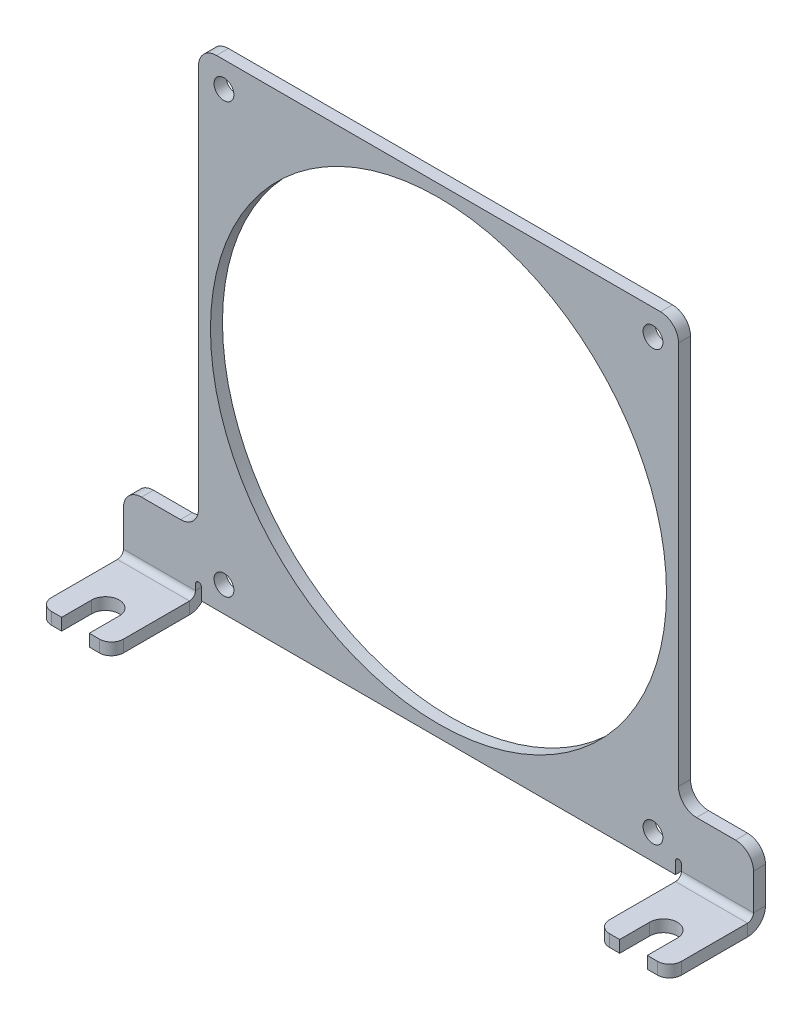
ISO-10303-21;
HEADER;
FILE_DESCRIPTION(('STEP AP214'),'2;1');
FILE_NAME('part.step','',(''),(''),'','','');
FILE_SCHEMA(('AUTOMOTIVE_DESIGN { 1 0 10303 214 1 1 1 1 }'));
ENDSEC;
DATA;
#1=APPLICATION_CONTEXT('core data for automotive mechanical design processes');
#2=APPLICATION_PROTOCOL_DEFINITION('international standard','automotive_design',2000,#1);
#3=PRODUCT_CONTEXT('',#1,'mechanical');
#4=PRODUCT('Part','Part','',(#3));
#5=PRODUCT_RELATED_PRODUCT_CATEGORY('part','',(#4));
#6=PRODUCT_DEFINITION_FORMATION('','',#4);
#7=PRODUCT_DEFINITION_CONTEXT('part definition',#1,'design');
#8=PRODUCT_DEFINITION('design','',#6,#7);
#9=PRODUCT_DEFINITION_SHAPE('','',#8);
#10=(LENGTH_UNIT() NAMED_UNIT(*) SI_UNIT(.MILLI.,.METRE.));
#11=(NAMED_UNIT(*) PLANE_ANGLE_UNIT() SI_UNIT($,.RADIAN.));
#12=(NAMED_UNIT(*) SI_UNIT($,.STERADIAN.) SOLID_ANGLE_UNIT());
#13=UNCERTAINTY_MEASURE_WITH_UNIT(LENGTH_MEASURE(1.E-05),#10,'distance_accuracy_value','');
#14=(GEOMETRIC_REPRESENTATION_CONTEXT(3) GLOBAL_UNCERTAINTY_ASSIGNED_CONTEXT((#13)) GLOBAL_UNIT_ASSIGNED_CONTEXT((#10,
#11,#12)) REPRESENTATION_CONTEXT('',''));
#15=CARTESIAN_POINT('',(0.,0.,0.));
#16=DIRECTION('',(0.,0.,1.));
#17=DIRECTION('',(1.,0.,0.));
#18=AXIS2_PLACEMENT_3D('',#15,#16,#17);
#19=CARTESIAN_POINT('',(0.,0.,-2.));
#20=DIRECTION('',(0.,0.,-1.));
#21=DIRECTION('',(-1.,0.,0.));
#22=AXIS2_PLACEMENT_3D('',#19,#20,#21);
#23=PLANE('',#22);
#24=DIRECTION('',(0.,-1.,0.));
#25=VECTOR('',#24,1.);
#26=CARTESIAN_POINT('',(-52.5,-40.,-2.));
#27=LINE('',#26,#25);
#28=CARTESIAN_POINT('',(-52.5,-33.,-2.));
#29=VERTEX_POINT('',#28);
#30=CARTESIAN_POINT('',(-52.5,-39.,-2.));
#31=VERTEX_POINT('',#30);
#32=EDGE_CURVE('E610',#29,#31,#27,.T.);
#33=ORIENTED_EDGE('',*,*,#32,.F.);
#34=CARTESIAN_POINT('',(-49.5,-33.,-2.));
#35=DIRECTION('',(0.,0.,-1.));
#36=DIRECTION('',(-1.,0.,0.));
#37=AXIS2_PLACEMENT_3D('',#34,#35,#36);
#38=CIRCLE('',#37,3.);
#39=CARTESIAN_POINT('',(-49.5,-30.,-2.));
#40=VERTEX_POINT('',#39);
#41=EDGE_CURVE('E734',#29,#40,#38,.T.);
#42=ORIENTED_EDGE('',*,*,#41,.T.);
#43=DIRECTION('',(1.,0.,0.));
#44=VECTOR('',#43,1.);
#45=CARTESIAN_POINT('',(-40.,-30.,-2.));
#46=LINE('',#45,#44);
#47=CARTESIAN_POINT('',(-43.,-30.,-2.));
#48=VERTEX_POINT('',#47);
#49=EDGE_CURVE('E756',#40,#48,#46,.T.);
#50=ORIENTED_EDGE('',*,*,#49,.T.);
#51=CARTESIAN_POINT('',(-43.,-27.,-2.));
#52=DIRECTION('',(0.,0.,-1.));
#53=DIRECTION('',(-1.,0.,0.));
#54=AXIS2_PLACEMENT_3D('',#51,#52,#53);
#55=CIRCLE('',#54,3.);
#56=CARTESIAN_POINT('',(-40.,-27.,-2.));
#57=VERTEX_POINT('',#56);
#58=EDGE_CURVE('E704',#48,#57,#55,.F.);
#59=ORIENTED_EDGE('',*,*,#58,.T.);
#60=DIRECTION('',(0.,1.,0.));
#61=VECTOR('',#60,1.);
#62=CARTESIAN_POINT('',(-40.,-30.,-2.));
#63=LINE('',#62,#61);
#64=CARTESIAN_POINT('',(-40.,37.,-2.));
#65=VERTEX_POINT('',#64);
#66=EDGE_CURVE('E753',#57,#65,#63,.T.);
#67=ORIENTED_EDGE('',*,*,#66,.T.);
#68=CARTESIAN_POINT('',(-37.,37.,-2.));
#69=DIRECTION('',(0.,0.,-1.));
#70=DIRECTION('',(-1.,0.,0.));
#71=AXIS2_PLACEMENT_3D('',#68,#69,#70);
#72=CIRCLE('',#71,3.);
#73=CARTESIAN_POINT('',(-37.,40.,-2.));
#74=VERTEX_POINT('',#73);
#75=EDGE_CURVE('E58',#65,#74,#72,.T.);
#76=ORIENTED_EDGE('',*,*,#75,.T.);
#77=DIRECTION('',(-1.,0.,0.));
#78=VECTOR('',#77,1.);
#79=CARTESIAN_POINT('',(-52.5,40.,-2.));
#80=LINE('',#79,#78);
#81=CARTESIAN_POINT('',(37.,40.,-2.));
#82=VERTEX_POINT('',#81);
#83=EDGE_CURVE('E606',#82,#74,#80,.T.);
#84=ORIENTED_EDGE('',*,*,#83,.F.);
#85=CARTESIAN_POINT('',(37.,37.,-2.));
#86=DIRECTION('',(0.,0.,-1.));
#87=DIRECTION('',(-1.,0.,0.));
#88=AXIS2_PLACEMENT_3D('',#85,#86,#87);
#89=CIRCLE('',#88,3.);
#90=CARTESIAN_POINT('',(40.,37.,-2.));
#91=VERTEX_POINT('',#90);
#92=EDGE_CURVE('E728',#82,#91,#89,.T.);
#93=ORIENTED_EDGE('',*,*,#92,.T.);
#94=DIRECTION('',(0.,-1.,0.));
#95=VECTOR('',#94,1.);
#96=CARTESIAN_POINT('',(40.,-30.,-2.));
#97=LINE('',#96,#95);
#98=CARTESIAN_POINT('',(40.,-27.,-2.));
#99=VERTEX_POINT('',#98);
#100=EDGE_CURVE('E777',#91,#99,#97,.T.);
#101=ORIENTED_EDGE('',*,*,#100,.T.);
#102=CARTESIAN_POINT('',(43.,-27.,-2.));
#103=DIRECTION('',(0.,0.,-1.));
#104=DIRECTION('',(-1.,0.,0.));
#105=AXIS2_PLACEMENT_3D('',#102,#103,#104);
#106=CIRCLE('',#105,3.);
#107=CARTESIAN_POINT('',(43.,-30.,-2.));
#108=VERTEX_POINT('',#107);
#109=EDGE_CURVE('E697',#99,#108,#106,.F.);
#110=ORIENTED_EDGE('',*,*,#109,.T.);
#111=DIRECTION('',(1.,0.,0.));
#112=VECTOR('',#111,1.);
#113=CARTESIAN_POINT('',(40.,-30.,-2.));
#114=LINE('',#113,#112);
#115=CARTESIAN_POINT('',(49.5,-30.,-2.));
#116=VERTEX_POINT('',#115);
#117=EDGE_CURVE('E786',#108,#116,#114,.T.);
#118=ORIENTED_EDGE('',*,*,#117,.T.);
#119=CARTESIAN_POINT('',(49.5,-33.,-2.));
#120=DIRECTION('',(0.,0.,-1.));
#121=DIRECTION('',(-1.,0.,0.));
#122=AXIS2_PLACEMENT_3D('',#119,#120,#121);
#123=CIRCLE('',#122,3.);
#124=CARTESIAN_POINT('',(52.5,-33.,-2.));
#125=VERTEX_POINT('',#124);
#126=EDGE_CURVE('E731',#116,#125,#123,.T.);
#127=ORIENTED_EDGE('',*,*,#126,.T.);
#128=DIRECTION('',(0.,1.,0.));
#129=VECTOR('',#128,1.);
#130=CARTESIAN_POINT('',(52.5,-40.,-2.));
#131=LINE('',#130,#129);
#132=CARTESIAN_POINT('',(52.5,-39.,-2.));
#133=VERTEX_POINT('',#132);
#134=EDGE_CURVE('E602',#133,#125,#131,.T.);
#135=ORIENTED_EDGE('',*,*,#134,.F.);
#136=DIRECTION('',(1.,0.,0.));
#137=VECTOR('',#136,1.);
#138=CARTESIAN_POINT('',(52.5,-39.,-2.));
#139=LINE('',#138,#137);
#140=CARTESIAN_POINT('',(40.5,-39.,-2.));
#141=VERTEX_POINT('',#140);
#142=EDGE_CURVE('E537',#133,#141,#139,.F.);
#143=ORIENTED_EDGE('',*,*,#142,.T.);
#144=DIRECTION('',(0.,1.,0.));
#145=VECTOR('',#144,1.);
#146=CARTESIAN_POINT('',(40.5,0.,-2.));
#147=LINE('',#146,#145);
#148=CARTESIAN_POINT('',(40.5,-38.,-2.));
#149=VERTEX_POINT('',#148);
#150=EDGE_CURVE('E598',#141,#149,#147,.T.);
#151=ORIENTED_EDGE('',*,*,#150,.T.);
#152=CARTESIAN_POINT('',(40.,-38.,-2.));
#153=DIRECTION('',(0.,0.,-1.));
#154=DIRECTION('',(-1.,0.,0.));
#155=AXIS2_PLACEMENT_3D('',#152,#153,#154);
#156=CIRCLE('',#155,0.5);
#157=CARTESIAN_POINT('',(39.5,-38.,-2.));
#158=VERTEX_POINT('',#157);
#159=EDGE_CURVE('E595',#149,#158,#156,.F.);
#160=ORIENTED_EDGE('',*,*,#159,.T.);
#161=DIRECTION('',(0.,-1.,0.));
#162=VECTOR('',#161,1.);
#163=CARTESIAN_POINT('',(39.5,0.,-2.));
#164=LINE('',#163,#162);
#165=CARTESIAN_POINT('',(39.5,-40.,-2.));
#166=VERTEX_POINT('',#165);
#167=EDGE_CURVE('E572',#158,#166,#164,.T.);
#168=ORIENTED_EDGE('',*,*,#167,.T.);
#169=DIRECTION('',(1.,0.,0.));
#170=VECTOR('',#169,1.);
#171=CARTESIAN_POINT('',(-52.5,-40.,-2.));
#172=LINE('',#171,#170);
#173=CARTESIAN_POINT('',(-39.5,-40.,-2.));
#174=VERTEX_POINT('',#173);
#175=EDGE_CURVE('E613',#174,#166,#172,.T.);
#176=ORIENTED_EDGE('',*,*,#175,.F.);
#177=DIRECTION('',(0.,1.,0.));
#178=VECTOR('',#177,1.);
#179=CARTESIAN_POINT('',(-39.5,0.,-2.));
#180=LINE('',#179,#178);
#181=CARTESIAN_POINT('',(-39.5,-38.,-2.));
#182=VERTEX_POINT('',#181);
#183=EDGE_CURVE('E456',#174,#182,#180,.T.);
#184=ORIENTED_EDGE('',*,*,#183,.T.);
#185=CARTESIAN_POINT('',(-40.,-38.,-2.));
#186=DIRECTION('',(0.,0.,-1.));
#187=DIRECTION('',(-1.,0.,0.));
#188=AXIS2_PLACEMENT_3D('',#185,#186,#187);
#189=CIRCLE('',#188,0.5);
#190=CARTESIAN_POINT('',(-40.5,-38.,-2.));
#191=VERTEX_POINT('',#190);
#192=EDGE_CURVE('E453',#182,#191,#189,.F.);
#193=ORIENTED_EDGE('',*,*,#192,.T.);
#194=DIRECTION('',(0.,-1.,0.));
#195=VECTOR('',#194,1.);
#196=CARTESIAN_POINT('',(-40.5,0.,-2.));
#197=LINE('',#196,#195);
#198=CARTESIAN_POINT('',(-40.5,-39.,-2.));
#199=VERTEX_POINT('',#198);
#200=EDGE_CURVE('E431',#191,#199,#197,.T.);
#201=ORIENTED_EDGE('',*,*,#200,.T.);
#202=DIRECTION('',(1.,0.,0.));
#203=VECTOR('',#202,1.);
#204=CARTESIAN_POINT('',(-40.5,-39.,-2.));
#205=LINE('',#204,#203);
#206=EDGE_CURVE('E395',#199,#31,#205,.F.);
#207=ORIENTED_EDGE('',*,*,#206,.T.);
#208=EDGE_LOOP('',(#33,#42,#50,#59,#67,#76,#84,#93,#101,#110,#118,#127,#135,#143,#151,#160,#168,
#176,#184,#193,#201,#207));
#209=FACE_BOUND('',#208,.T.);
#210=CARTESIAN_POINT('',(-35.75,-35.7499999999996,-2.));
#211=DIRECTION('',(0.,0.,1.));
#212=DIRECTION('',(1.,0.,0.));
#213=AXIS2_PLACEMENT_3D('',#210,#211,#212);
#214=CIRCLE('',#213,1.65);
#215=CARTESIAN_POINT('',(-34.1,-35.7499999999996,-2.));
#216=VERTEX_POINT('',#215);
#217=EDGE_CURVE('E791',#216,#216,#214,.T.);
#218=ORIENTED_EDGE('',*,*,#217,.T.);
#219=EDGE_LOOP('',(#218));
#220=FACE_BOUND('',#219,.T.);
#221=CARTESIAN_POINT('',(-35.7499999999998,35.7500000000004,-2.));
#222=DIRECTION('',(0.,0.,1.));
#223=DIRECTION('',(1.,0.,0.));
#224=AXIS2_PLACEMENT_3D('',#221,#222,#223);
#225=CIRCLE('',#224,1.65);
#226=CARTESIAN_POINT('',(-34.0999999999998,35.7500000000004,-2.));
#227=VERTEX_POINT('',#226);
#228=EDGE_CURVE('E762',#227,#227,#225,.T.);
#229=ORIENTED_EDGE('',*,*,#228,.T.);
#230=EDGE_LOOP('',(#229));
#231=FACE_BOUND('',#230,.T.);
#232=CARTESIAN_POINT('',(35.7500000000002,35.7500000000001,-2.));
#233=DIRECTION('',(0.,0.,1.));
#234=DIRECTION('',(1.,0.,0.));
#235=AXIS2_PLACEMENT_3D('',#232,#233,#234);
#236=CIRCLE('',#235,1.65);
#237=CARTESIAN_POINT('',(37.4000000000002,35.7500000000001,-2.));
#238=VERTEX_POINT('',#237);
#239=EDGE_CURVE('E761',#238,#238,#236,.T.);
#240=ORIENTED_EDGE('',*,*,#239,.T.);
#241=EDGE_LOOP('',(#240));
#242=FACE_BOUND('',#241,.T.);
#243=CARTESIAN_POINT('',(0.,2.56739074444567E-13,-2.));
#244=DIRECTION('',(0.,0.,1.));
#245=DIRECTION('',(1.,0.,0.));
#246=AXIS2_PLACEMENT_3D('',#243,#244,#245);
#247=CIRCLE('',#246,38.);
#248=CARTESIAN_POINT('',(38.,2.56739074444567E-13,-2.));
#249=VERTEX_POINT('',#248);
#250=EDGE_CURVE('E781',#249,#249,#247,.T.);
#251=ORIENTED_EDGE('',*,*,#250,.T.);
#252=EDGE_LOOP('',(#251));
#253=FACE_BOUND('',#252,.T.);
#254=CARTESIAN_POINT('',(35.75,-35.7499999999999,-2.));
#255=DIRECTION('',(0.,0.,1.));
#256=DIRECTION('',(1.,0.,0.));
#257=AXIS2_PLACEMENT_3D('',#254,#255,#256);
#258=CIRCLE('',#257,1.65);
#259=CARTESIAN_POINT('',(37.4,-35.7499999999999,-2.));
#260=VERTEX_POINT('',#259);
#261=EDGE_CURVE('E806',#260,#260,#258,.T.);
#262=ORIENTED_EDGE('',*,*,#261,.T.);
#263=EDGE_LOOP('',(#262));
#264=FACE_BOUND('',#263,.T.);
#265=ADVANCED_FACE('F42',(#209,#220,#231,#242,#253,#264),#23,.T.);
#266=CARTESIAN_POINT('',(0.,0.,0.));
#267=DIRECTION('',(0.,0.,-1.));
#268=DIRECTION('',(-1.,0.,0.));
#269=AXIS2_PLACEMENT_3D('',#266,#267,#268);
#270=PLANE('',#269);
#271=CARTESIAN_POINT('',(-35.75,-35.7499999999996,0.));
#272=DIRECTION('',(0.,0.,1.));
#273=DIRECTION('',(1.,0.,0.));
#274=AXIS2_PLACEMENT_3D('',#271,#272,#273);
#275=CIRCLE('',#274,1.65);
#276=CARTESIAN_POINT('',(-34.1,-35.7499999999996,0.));
#277=VERTEX_POINT('',#276);
#278=EDGE_CURVE('E755',#277,#277,#275,.T.);
#279=ORIENTED_EDGE('',*,*,#278,.F.);
#280=EDGE_LOOP('',(#279));
#281=FACE_BOUND('',#280,.T.);
#282=CARTESIAN_POINT('',(-35.7499999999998,35.7500000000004,0.));
#283=DIRECTION('',(0.,0.,1.));
#284=DIRECTION('',(1.,0.,0.));
#285=AXIS2_PLACEMENT_3D('',#282,#283,#284);
#286=CIRCLE('',#285,1.65);
#287=CARTESIAN_POINT('',(-34.0999999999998,35.7500000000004,0.));
#288=VERTEX_POINT('',#287);
#289=EDGE_CURVE('E789',#288,#288,#286,.T.);
#290=ORIENTED_EDGE('',*,*,#289,.F.);
#291=EDGE_LOOP('',(#290));
#292=FACE_BOUND('',#291,.T.);
#293=CARTESIAN_POINT('',(35.7500000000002,35.7500000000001,0.));
#294=DIRECTION('',(0.,0.,1.));
#295=DIRECTION('',(1.,0.,0.));
#296=AXIS2_PLACEMENT_3D('',#293,#294,#295);
#297=CIRCLE('',#296,1.65);
#298=CARTESIAN_POINT('',(37.4000000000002,35.7500000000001,0.));
#299=VERTEX_POINT('',#298);
#300=EDGE_CURVE('E758',#299,#299,#297,.T.);
#301=ORIENTED_EDGE('',*,*,#300,.F.);
#302=EDGE_LOOP('',(#301));
#303=FACE_BOUND('',#302,.T.);
#304=CARTESIAN_POINT('',(0.,2.56739074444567E-13,0.));
#305=DIRECTION('',(0.,0.,1.));
#306=DIRECTION('',(1.,0.,0.));
#307=AXIS2_PLACEMENT_3D('',#304,#305,#306);
#308=CIRCLE('',#307,38.);
#309=CARTESIAN_POINT('',(38.,2.56739074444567E-13,0.));
#310=VERTEX_POINT('',#309);
#311=EDGE_CURVE('E783',#310,#310,#308,.T.);
#312=ORIENTED_EDGE('',*,*,#311,.F.);
#313=EDGE_LOOP('',(#312));
#314=FACE_BOUND('',#313,.T.);
#315=DIRECTION('',(1.,0.,0.));
#316=VECTOR('',#315,1.);
#317=CARTESIAN_POINT('',(-40.,-30.,0.));
#318=LINE('',#317,#316);
#319=CARTESIAN_POINT('',(-49.5,-30.,0.));
#320=VERTEX_POINT('',#319);
#321=CARTESIAN_POINT('',(-43.,-30.,0.));
#322=VERTEX_POINT('',#321);
#323=EDGE_CURVE('E766',#320,#322,#318,.T.);
#324=ORIENTED_EDGE('',*,*,#323,.F.);
#325=CARTESIAN_POINT('',(-49.5,-33.,0.));
#326=DIRECTION('',(0.,0.,-1.));
#327=DIRECTION('',(-1.,0.,0.));
#328=AXIS2_PLACEMENT_3D('',#325,#326,#327);
#329=CIRCLE('',#328,3.);
#330=CARTESIAN_POINT('',(-52.5,-33.,0.));
#331=VERTEX_POINT('',#330);
#332=EDGE_CURVE('E720',#320,#331,#329,.F.);
#333=ORIENTED_EDGE('',*,*,#332,.T.);
#334=DIRECTION('',(0.,-1.,0.));
#335=VECTOR('',#334,1.);
#336=CARTESIAN_POINT('',(-52.5,-40.,0.));
#337=LINE('',#336,#335);
#338=CARTESIAN_POINT('',(-52.5,-39.,0.));
#339=VERTEX_POINT('',#338);
#340=EDGE_CURVE('E624',#331,#339,#337,.T.);
#341=ORIENTED_EDGE('',*,*,#340,.T.);
#342=DIRECTION('',(1.,0.,0.));
#343=VECTOR('',#342,1.);
#344=CARTESIAN_POINT('',(-40.5,-39.,0.));
#345=LINE('',#344,#343);
#346=CARTESIAN_POINT('',(-40.5,-39.,0.));
#347=VERTEX_POINT('',#346);
#348=EDGE_CURVE('E412',#347,#339,#345,.F.);
#349=ORIENTED_EDGE('',*,*,#348,.F.);
#350=DIRECTION('',(0.,-1.,0.));
#351=VECTOR('',#350,1.);
#352=CARTESIAN_POINT('',(-40.5,-38.,0.));
#353=LINE('',#352,#351);
#354=CARTESIAN_POINT('',(-40.5,-38.,0.));
#355=VERTEX_POINT('',#354);
#356=EDGE_CURVE('E438',#355,#347,#353,.T.);
#357=ORIENTED_EDGE('',*,*,#356,.F.);
#358=CARTESIAN_POINT('',(-40.,-38.,0.));
#359=DIRECTION('',(0.,0.,1.));
#360=DIRECTION('',(1.,0.,0.));
#361=AXIS2_PLACEMENT_3D('',#358,#359,#360);
#362=CIRCLE('',#361,0.5);
#363=CARTESIAN_POINT('',(-39.5,-38.,0.));
#364=VERTEX_POINT('',#363);
#365=EDGE_CURVE('E433',#364,#355,#362,.T.);
#366=ORIENTED_EDGE('',*,*,#365,.F.);
#367=DIRECTION('',(0.,1.,0.));
#368=VECTOR('',#367,1.);
#369=CARTESIAN_POINT('',(-39.5,-40.,0.));
#370=LINE('',#369,#368);
#371=CARTESIAN_POINT('',(-39.5,-40.,0.));
#372=VERTEX_POINT('',#371);
#373=EDGE_CURVE('E427',#372,#364,#370,.T.);
#374=ORIENTED_EDGE('',*,*,#373,.F.);
#375=DIRECTION('',(1.,0.,0.));
#376=VECTOR('',#375,1.);
#377=CARTESIAN_POINT('',(-52.5,-40.,0.));
#378=LINE('',#377,#376);
#379=CARTESIAN_POINT('',(39.5,-40.,0.));
#380=VERTEX_POINT('',#379);
#381=EDGE_CURVE('E607',#372,#380,#378,.T.);
#382=ORIENTED_EDGE('',*,*,#381,.T.);
#383=DIRECTION('',(0.,-1.,0.));
#384=VECTOR('',#383,1.);
#385=CARTESIAN_POINT('',(39.5,-38.,0.));
#386=LINE('',#385,#384);
#387=CARTESIAN_POINT('',(39.5,-38.,0.));
#388=VERTEX_POINT('',#387);
#389=EDGE_CURVE('E578',#388,#380,#386,.T.);
#390=ORIENTED_EDGE('',*,*,#389,.F.);
#391=CARTESIAN_POINT('',(40.,-38.,0.));
#392=DIRECTION('',(0.,0.,1.));
#393=DIRECTION('',(1.,0.,0.));
#394=AXIS2_PLACEMENT_3D('',#391,#392,#393);
#395=CIRCLE('',#394,0.5);
#396=CARTESIAN_POINT('',(40.5,-38.,0.));
#397=VERTEX_POINT('',#396);
#398=EDGE_CURVE('E573',#397,#388,#395,.T.);
#399=ORIENTED_EDGE('',*,*,#398,.F.);
#400=DIRECTION('',(0.,1.,0.));
#401=VECTOR('',#400,1.);
#402=CARTESIAN_POINT('',(40.5,-39.,0.));
#403=LINE('',#402,#401);
#404=CARTESIAN_POINT('',(40.5,-39.,0.));
#405=VERTEX_POINT('',#404);
#406=EDGE_CURVE('E568',#405,#397,#403,.T.);
#407=ORIENTED_EDGE('',*,*,#406,.F.);
#408=DIRECTION('',(1.,0.,0.));
#409=VECTOR('',#408,1.);
#410=CARTESIAN_POINT('',(52.5,-39.,0.));
#411=LINE('',#410,#409);
#412=CARTESIAN_POINT('',(52.5,-39.,0.));
#413=VERTEX_POINT('',#412);
#414=EDGE_CURVE('E554',#413,#405,#411,.F.);
#415=ORIENTED_EDGE('',*,*,#414,.F.);
#416=DIRECTION('',(0.,1.,0.));
#417=VECTOR('',#416,1.);
#418=CARTESIAN_POINT('',(52.5,-40.,0.));
#419=LINE('',#418,#417);
#420=CARTESIAN_POINT('',(52.5,-33.,0.));
#421=VERTEX_POINT('',#420);
#422=EDGE_CURVE('E601',#413,#421,#419,.T.);
#423=ORIENTED_EDGE('',*,*,#422,.T.);
#424=CARTESIAN_POINT('',(49.5,-33.,0.));
#425=DIRECTION('',(0.,0.,-1.));
#426=DIRECTION('',(-1.,0.,0.));
#427=AXIS2_PLACEMENT_3D('',#424,#425,#426);
#428=CIRCLE('',#427,3.);
#429=CARTESIAN_POINT('',(49.5,-30.,0.));
#430=VERTEX_POINT('',#429);
#431=EDGE_CURVE('E717',#421,#430,#428,.F.);
#432=ORIENTED_EDGE('',*,*,#431,.T.);
#433=DIRECTION('',(1.,0.,0.));
#434=VECTOR('',#433,1.);
#435=CARTESIAN_POINT('',(40.,-30.,0.));
#436=LINE('',#435,#434);
#437=CARTESIAN_POINT('',(43.,-30.,0.));
#438=VERTEX_POINT('',#437);
#439=EDGE_CURVE('E775',#438,#430,#436,.T.);
#440=ORIENTED_EDGE('',*,*,#439,.F.);
#441=CARTESIAN_POINT('',(43.,-27.,0.));
#442=DIRECTION('',(0.,0.,-1.));
#443=DIRECTION('',(-1.,0.,0.));
#444=AXIS2_PLACEMENT_3D('',#441,#442,#443);
#445=CIRCLE('',#444,3.);
#446=CARTESIAN_POINT('',(40.,-27.,0.));
#447=VERTEX_POINT('',#446);
#448=EDGE_CURVE('E693',#438,#447,#445,.T.);
#449=ORIENTED_EDGE('',*,*,#448,.T.);
#450=DIRECTION('',(0.,-1.,0.));
#451=VECTOR('',#450,1.);
#452=CARTESIAN_POINT('',(40.,-30.,0.));
#453=LINE('',#452,#451);
#454=CARTESIAN_POINT('',(40.,37.,0.));
#455=VERTEX_POINT('',#454);
#456=EDGE_CURVE('E778',#455,#447,#453,.T.);
#457=ORIENTED_EDGE('',*,*,#456,.F.);
#458=CARTESIAN_POINT('',(37.,37.,0.));
#459=DIRECTION('',(0.,0.,-1.));
#460=DIRECTION('',(-1.,0.,0.));
#461=AXIS2_PLACEMENT_3D('',#458,#459,#460);
#462=CIRCLE('',#461,3.);
#463=CARTESIAN_POINT('',(37.,40.,0.));
#464=VERTEX_POINT('',#463);
#465=EDGE_CURVE('E714',#455,#464,#462,.F.);
#466=ORIENTED_EDGE('',*,*,#465,.T.);
#467=DIRECTION('',(-1.,0.,0.));
#468=VECTOR('',#467,1.);
#469=CARTESIAN_POINT('',(-52.5,40.,0.));
#470=LINE('',#469,#468);
#471=CARTESIAN_POINT('',(-37.,40.,0.));
#472=VERTEX_POINT('',#471);
#473=EDGE_CURVE('E620',#464,#472,#470,.T.);
#474=ORIENTED_EDGE('',*,*,#473,.T.);
#475=CARTESIAN_POINT('',(-37.,37.,0.));
#476=DIRECTION('',(0.,0.,-1.));
#477=DIRECTION('',(-1.,0.,0.));
#478=AXIS2_PLACEMENT_3D('',#475,#476,#477);
#479=CIRCLE('',#478,3.);
#480=CARTESIAN_POINT('',(-40.,37.,0.));
#481=VERTEX_POINT('',#480);
#482=EDGE_CURVE('E711',#472,#481,#479,.F.);
#483=ORIENTED_EDGE('',*,*,#482,.T.);
#484=DIRECTION('',(0.,1.,0.));
#485=VECTOR('',#484,1.);
#486=CARTESIAN_POINT('',(-40.,-30.,0.));
#487=LINE('',#486,#485);
#488=CARTESIAN_POINT('',(-40.,-27.,0.));
#489=VERTEX_POINT('',#488);
#490=EDGE_CURVE('E764',#489,#481,#487,.T.);
#491=ORIENTED_EDGE('',*,*,#490,.F.);
#492=CARTESIAN_POINT('',(-43.,-27.,0.));
#493=DIRECTION('',(0.,0.,-1.));
#494=DIRECTION('',(-1.,0.,0.));
#495=AXIS2_PLACEMENT_3D('',#492,#493,#494);
#496=CIRCLE('',#495,3.);
#497=EDGE_CURVE('E700',#489,#322,#496,.T.);
#498=ORIENTED_EDGE('',*,*,#497,.T.);
#499=EDGE_LOOP('',(#324,#333,#341,#349,#357,#366,#374,#382,#390,#399,#407,#415,#423,#432,#440,
#449,#457,#466,#474,#483,#491,#498));
#500=FACE_BOUND('',#499,.T.);
#501=CARTESIAN_POINT('',(35.75,-35.7499999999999,0.));
#502=DIRECTION('',(0.,0.,1.));
#503=DIRECTION('',(1.,0.,0.));
#504=AXIS2_PLACEMENT_3D('',#501,#502,#503);
#505=CIRCLE('',#504,1.65);
#506=CARTESIAN_POINT('',(37.4,-35.7499999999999,0.));
#507=VERTEX_POINT('',#506);
#508=EDGE_CURVE('E800',#507,#507,#505,.T.);
#509=ORIENTED_EDGE('',*,*,#508,.F.);
#510=EDGE_LOOP('',(#509));
#511=FACE_BOUND('',#510,.T.);
#512=ADVANCED_FACE('F855',(#281,#292,#303,#314,#500,#511),#270,.F.);
#513=CARTESIAN_POINT('',(-52.5,-40.,-2.));
#514=DIRECTION('',(0.,-1.,0.));
#515=DIRECTION('',(0.,0.,-1.));
#516=AXIS2_PLACEMENT_3D('',#513,#514,#515);
#517=PLANE('',#516);
#518=ORIENTED_EDGE('',*,*,#381,.F.);
#519=DIRECTION('',(0.,0.,-1.));
#520=VECTOR('',#519,1.);
#521=CARTESIAN_POINT('',(-39.5,-40.,0.));
#522=LINE('',#521,#520);
#523=EDGE_CURVE('E432',#372,#174,#522,.T.);
#524=ORIENTED_EDGE('',*,*,#523,.T.);
#525=ORIENTED_EDGE('',*,*,#175,.T.);
#526=DIRECTION('',(0.,0.,-1.));
#527=VECTOR('',#526,1.);
#528=CARTESIAN_POINT('',(39.5,-40.,0.));
#529=LINE('',#528,#527);
#530=EDGE_CURVE('E582',#380,#166,#529,.T.);
#531=ORIENTED_EDGE('',*,*,#530,.F.);
#532=EDGE_LOOP('',(#518,#524,#525,#531));
#533=FACE_BOUND('',#532,.T.);
#534=ADVANCED_FACE('F897',(#533),#517,.T.);
#535=CARTESIAN_POINT('',(52.5,-40.,-2.));
#536=DIRECTION('',(1.,0.,0.));
#537=DIRECTION('',(0.,0.,-1.));
#538=AXIS2_PLACEMENT_3D('',#535,#536,#537);
#539=PLANE('',#538);
#540=ORIENTED_EDGE('',*,*,#134,.T.);
#541=DIRECTION('',(0.,0.,1.));
#542=VECTOR('',#541,1.);
#543=CARTESIAN_POINT('',(52.5,-33.,0.));
#544=LINE('',#543,#542);
#545=EDGE_CURVE('E737',#125,#421,#544,.T.);
#546=ORIENTED_EDGE('',*,*,#545,.T.);
#547=ORIENTED_EDGE('',*,*,#422,.F.);
#548=DIRECTION('',(0.,0.,-1.));
#549=VECTOR('',#548,1.);
#550=CARTESIAN_POINT('',(52.5,-39.,0.));
#551=LINE('',#550,#549);
#552=EDGE_CURVE('E546',#413,#133,#551,.T.);
#553=ORIENTED_EDGE('',*,*,#552,.T.);
#554=EDGE_LOOP('',(#540,#546,#547,#553));
#555=FACE_BOUND('',#554,.T.);
#556=ADVANCED_FACE('F851',(#555),#539,.T.);
#557=CARTESIAN_POINT('',(-52.5,-40.,-2.));
#558=DIRECTION('',(-1.,0.,0.));
#559=DIRECTION('',(0.,0.,1.));
#560=AXIS2_PLACEMENT_3D('',#557,#558,#559);
#561=PLANE('',#560);
#562=ORIENTED_EDGE('',*,*,#340,.F.);
#563=DIRECTION('',(0.,0.,1.));
#564=VECTOR('',#563,1.);
#565=CARTESIAN_POINT('',(-52.5,-33.,-2.));
#566=LINE('',#565,#564);
#567=EDGE_CURVE('E723',#331,#29,#566,.F.);
#568=ORIENTED_EDGE('',*,*,#567,.T.);
#569=ORIENTED_EDGE('',*,*,#32,.T.);
#570=DIRECTION('',(0.,0.,-1.));
#571=VECTOR('',#570,1.);
#572=CARTESIAN_POINT('',(-52.5,-39.,0.));
#573=LINE('',#572,#571);
#574=EDGE_CURVE('E419',#339,#31,#573,.T.);
#575=ORIENTED_EDGE('',*,*,#574,.F.);
#576=EDGE_LOOP('',(#562,#568,#569,#575));
#577=FACE_BOUND('',#576,.T.);
#578=ADVANCED_FACE('F922',(#577),#561,.T.);
#579=CARTESIAN_POINT('',(-52.5,40.,-2.));
#580=DIRECTION('',(0.,1.,0.));
#581=DIRECTION('',(0.,0.,1.));
#582=AXIS2_PLACEMENT_3D('',#579,#580,#581);
#583=PLANE('',#582);
#584=ORIENTED_EDGE('',*,*,#473,.F.);
#585=DIRECTION('',(0.,0.,1.));
#586=VECTOR('',#585,1.);
#587=CARTESIAN_POINT('',(37.,40.,-2.));
#588=LINE('',#587,#586);
#589=EDGE_CURVE('E51',#464,#82,#588,.F.);
#590=ORIENTED_EDGE('',*,*,#589,.T.);
#591=ORIENTED_EDGE('',*,*,#83,.T.);
#592=DIRECTION('',(0.,0.,1.));
#593=VECTOR('',#592,1.);
#594=CARTESIAN_POINT('',(-37.,40.,0.));
#595=LINE('',#594,#593);
#596=EDGE_CURVE('E748',#74,#472,#595,.T.);
#597=ORIENTED_EDGE('',*,*,#596,.T.);
#598=EDGE_LOOP('',(#584,#590,#591,#597));
#599=FACE_BOUND('',#598,.T.);
#600=ADVANCED_FACE('F942',(#599),#583,.T.);
#601=CARTESIAN_POINT('',(40.5,-39.,0.));
#602=DIRECTION('',(-1.,0.,0.));
#603=DIRECTION('',(0.,0.,1.));
#604=AXIS2_PLACEMENT_3D('',#601,#602,#603);
#605=PLANE('',#604);
#606=ORIENTED_EDGE('',*,*,#150,.F.);
#607=DIRECTION('',(0.,0.,-1.));
#608=VECTOR('',#607,1.);
#609=CARTESIAN_POINT('',(40.5,-39.,0.));
#610=LINE('',#609,#608);
#611=EDGE_CURVE('E560',#405,#141,#610,.T.);
#612=ORIENTED_EDGE('',*,*,#611,.F.);
#613=ORIENTED_EDGE('',*,*,#406,.T.);
#614=DIRECTION('',(0.,0.,-1.));
#615=VECTOR('',#614,1.);
#616=CARTESIAN_POINT('',(40.5,-38.,0.));
#617=LINE('',#616,#615);
#618=EDGE_CURVE('E577',#397,#149,#617,.T.);
#619=ORIENTED_EDGE('',*,*,#618,.T.);
#620=EDGE_LOOP('',(#606,#612,#613,#619));
#621=FACE_BOUND('',#620,.T.);
#622=ADVANCED_FACE('F885',(#621),#605,.T.);
#623=CARTESIAN_POINT('',(40.,-38.,0.));
#624=DIRECTION('',(0.,0.,-1.));
#625=DIRECTION('',(0.,1.,0.));
#626=AXIS2_PLACEMENT_3D('',#623,#624,#625);
#627=CYLINDRICAL_SURFACE('',#626,0.5);
#628=ORIENTED_EDGE('',*,*,#159,.F.);
#629=ORIENTED_EDGE('',*,*,#618,.F.);
#630=ORIENTED_EDGE('',*,*,#398,.T.);
#631=DIRECTION('',(0.,0.,-1.));
#632=VECTOR('',#631,1.);
#633=CARTESIAN_POINT('',(39.5,-38.,0.));
#634=LINE('',#633,#632);
#635=EDGE_CURVE('E564',#388,#158,#634,.T.);
#636=ORIENTED_EDGE('',*,*,#635,.T.);
#637=EDGE_LOOP('',(#628,#629,#630,#636));
#638=FACE_BOUND('',#637,.T.);
#639=ADVANCED_FACE('F888',(#638),#627,.F.);
#640=CARTESIAN_POINT('',(39.5,-38.,0.));
#641=DIRECTION('',(1.,0.,0.));
#642=DIRECTION('',(0.,0.,-1.));
#643=AXIS2_PLACEMENT_3D('',#640,#641,#642);
#644=PLANE('',#643);
#645=ORIENTED_EDGE('',*,*,#167,.F.);
#646=ORIENTED_EDGE('',*,*,#635,.F.);
#647=ORIENTED_EDGE('',*,*,#389,.T.);
#648=ORIENTED_EDGE('',*,*,#530,.T.);
#649=EDGE_LOOP('',(#645,#646,#647,#648));
#650=FACE_BOUND('',#649,.T.);
#651=ADVANCED_FACE('F893',(#650),#644,.T.);
#652=CARTESIAN_POINT('',(40.5,-39.,1.));
#653=DIRECTION('',(-1.,0.,0.));
#654=DIRECTION('',(0.,0.,1.));
#655=AXIS2_PLACEMENT_3D('',#652,#653,#654);
#656=PLANE('',#655);
#657=DIRECTION('',(0.,-1.,0.));
#658=VECTOR('',#657,1.);
#659=CARTESIAN_POINT('',(40.5,-40.,1.));
#660=LINE('',#659,#658);
#661=CARTESIAN_POINT('',(40.5,-40.,1.));
#662=VERTEX_POINT('',#661);
#663=CARTESIAN_POINT('',(40.5,-42.,0.999999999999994));
#664=VERTEX_POINT('',#663);
#665=EDGE_CURVE('E459',#662,#664,#660,.T.);
#666=ORIENTED_EDGE('',*,*,#665,.F.);
#667=CARTESIAN_POINT('',(40.5,-39.,1.));
#668=DIRECTION('',(1.,0.,0.));
#669=DIRECTION('',(0.,0.,-1.));
#670=AXIS2_PLACEMENT_3D('',#667,#668,#669);
#671=CIRCLE('',#670,0.999999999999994);
#672=EDGE_CURVE('E550',#405,#662,#671,.F.);
#673=ORIENTED_EDGE('',*,*,#672,.F.);
#674=ORIENTED_EDGE('',*,*,#611,.T.);
#675=CARTESIAN_POINT('',(40.5,-39.,1.));
#676=DIRECTION('',(1.,0.,0.));
#677=DIRECTION('',(0.,0.,-1.));
#678=AXIS2_PLACEMENT_3D('',#675,#676,#677);
#679=CIRCLE('',#678,2.99999999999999);
#680=EDGE_CURVE('E541',#141,#664,#679,.F.);
#681=ORIENTED_EDGE('',*,*,#680,.T.);
#682=EDGE_LOOP('',(#666,#673,#674,#681));
#683=FACE_BOUND('',#682,.T.);
#684=ADVANCED_FACE('F867',(#683),#656,.T.);
#685=CARTESIAN_POINT('',(52.5,-39.,0.999999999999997));
#686=DIRECTION('',(-1.,0.,0.));
#687=DIRECTION('',(0.,0.,1.));
#688=AXIS2_PLACEMENT_3D('',#685,#686,#687);
#689=PLANE('',#688);
#690=CARTESIAN_POINT('',(52.5,-39.,0.999999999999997));
#691=DIRECTION('',(1.,0.,0.));
#692=DIRECTION('',(0.,0.,-1.));
#693=AXIS2_PLACEMENT_3D('',#690,#691,#692);
#694=CIRCLE('',#693,0.999999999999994);
#695=CARTESIAN_POINT('',(52.5,-40.,0.999999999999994));
#696=VERTEX_POINT('',#695);
#697=EDGE_CURVE('E536',#696,#413,#694,.T.);
#698=ORIENTED_EDGE('',*,*,#697,.F.);
#699=DIRECTION('',(0.,-1.,0.));
#700=VECTOR('',#699,1.);
#701=CARTESIAN_POINT('',(52.5,-40.,0.999999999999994));
#702=LINE('',#701,#700);
#703=CARTESIAN_POINT('',(52.5,-42.,0.99999999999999));
#704=VERTEX_POINT('',#703);
#705=EDGE_CURVE('E463',#696,#704,#702,.T.);
#706=ORIENTED_EDGE('',*,*,#705,.T.);
#707=CARTESIAN_POINT('',(52.5,-39.,0.999999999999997));
#708=DIRECTION('',(1.,0.,0.));
#709=DIRECTION('',(0.,0.,-1.));
#710=AXIS2_PLACEMENT_3D('',#707,#708,#709);
#711=CIRCLE('',#710,2.99999999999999);
#712=EDGE_CURVE('E542',#704,#133,#711,.T.);
#713=ORIENTED_EDGE('',*,*,#712,.T.);
#714=ORIENTED_EDGE('',*,*,#552,.F.);
#715=EDGE_LOOP('',(#698,#706,#713,#714));
#716=FACE_BOUND('',#715,.T.);
#717=ADVANCED_FACE('F880',(#716),#689,.F.);
#718=CARTESIAN_POINT('',(52.5,-39.,0.999999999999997));
#719=DIRECTION('',(1.,0.,0.));
#720=DIRECTION('',(0.,-1.,0.));
#721=AXIS2_PLACEMENT_3D('',#718,#719,#720);
#722=CYLINDRICAL_SURFACE('',#721,2.99999999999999);
#723=ORIENTED_EDGE('',*,*,#142,.F.);
#724=ORIENTED_EDGE('',*,*,#712,.F.);
#725=DIRECTION('',(1.,0.,0.));
#726=VECTOR('',#725,1.);
#727=CARTESIAN_POINT('',(46.5,-42.,0.99999999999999));
#728=LINE('',#727,#726);
#729=EDGE_CURVE('E467',#664,#704,#728,.T.);
#730=ORIENTED_EDGE('',*,*,#729,.F.);
#731=ORIENTED_EDGE('',*,*,#680,.F.);
#732=EDGE_LOOP('',(#723,#724,#730,#731));
#733=FACE_BOUND('',#732,.T.);
#734=ADVANCED_FACE('F1332',(#733),#722,.T.);
#735=CARTESIAN_POINT('',(52.5,-39.,0.999999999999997));
#736=DIRECTION('',(1.,0.,0.));
#737=DIRECTION('',(0.,-1.,0.));
#738=AXIS2_PLACEMENT_3D('',#735,#736,#737);
#739=CYLINDRICAL_SURFACE('',#738,0.999999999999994);
#740=ORIENTED_EDGE('',*,*,#414,.T.);
#741=ORIENTED_EDGE('',*,*,#672,.T.);
#742=DIRECTION('',(1.,0.,0.));
#743=VECTOR('',#742,1.);
#744=CARTESIAN_POINT('',(40.5,-40.,1.));
#745=LINE('',#744,#743);
#746=EDGE_CURVE('E460',#662,#696,#745,.T.);
#747=ORIENTED_EDGE('',*,*,#746,.T.);
#748=ORIENTED_EDGE('',*,*,#697,.T.);
#749=EDGE_LOOP('',(#740,#741,#747,#748));
#750=FACE_BOUND('',#749,.T.);
#751=ADVANCED_FACE('F862',(#750),#739,.F.);
#752=CARTESIAN_POINT('',(40.5,-42.,0.));
#753=DIRECTION('',(1.,0.,0.));
#754=DIRECTION('',(0.,0.,-1.));
#755=AXIS2_PLACEMENT_3D('',#752,#753,#754);
#756=PLANE('',#755);
#757=DIRECTION('',(0.,0.,-1.));
#758=VECTOR('',#757,1.);
#759=CARTESIAN_POINT('',(40.5,-42.,0.));
#760=LINE('',#759,#758);
#761=CARTESIAN_POINT('',(40.5,-42.,12.));
#762=VERTEX_POINT('',#761);
#763=EDGE_CURVE('E475',#762,#664,#760,.T.);
#764=ORIENTED_EDGE('',*,*,#763,.F.);
#765=DIRECTION('',(0.,1.,0.));
#766=VECTOR('',#765,1.);
#767=CARTESIAN_POINT('',(40.5,-42.,12.));
#768=LINE('',#767,#766);
#769=CARTESIAN_POINT('',(40.5,-40.,12.));
#770=VERTEX_POINT('',#769);
#771=EDGE_CURVE('E665',#762,#770,#768,.T.);
#772=ORIENTED_EDGE('',*,*,#771,.T.);
#773=DIRECTION('',(0.,0.,-1.));
#774=VECTOR('',#773,1.);
#775=CARTESIAN_POINT('',(40.5,-40.,0.));
#776=LINE('',#775,#774);
#777=EDGE_CURVE('E474',#770,#662,#776,.T.);
#778=ORIENTED_EDGE('',*,*,#777,.T.);
#779=ORIENTED_EDGE('',*,*,#665,.T.);
#780=EDGE_LOOP('',(#764,#772,#778,#779));
#781=FACE_BOUND('',#780,.T.);
#782=ADVANCED_FACE('F870',(#781),#756,.F.);
#783=CARTESIAN_POINT('',(52.5,-42.,14.));
#784=DIRECTION('',(-1.,0.,0.));
#785=DIRECTION('',(0.,0.,1.));
#786=AXIS2_PLACEMENT_3D('',#783,#784,#785);
#787=PLANE('',#786);
#788=DIRECTION('',(0.,0.,1.));
#789=VECTOR('',#788,1.);
#790=CARTESIAN_POINT('',(52.5,-40.,14.));
#791=LINE('',#790,#789);
#792=CARTESIAN_POINT('',(52.5,-40.,12.));
#793=VERTEX_POINT('',#792);
#794=EDGE_CURVE('E502',#696,#793,#791,.T.);
#795=ORIENTED_EDGE('',*,*,#794,.T.);
#796=DIRECTION('',(0.,1.,0.));
#797=VECTOR('',#796,1.);
#798=CARTESIAN_POINT('',(52.5,-42.,12.));
#799=LINE('',#798,#797);
#800=CARTESIAN_POINT('',(52.5,-42.,12.));
#801=VERTEX_POINT('',#800);
#802=EDGE_CURVE('E638',#793,#801,#799,.F.);
#803=ORIENTED_EDGE('',*,*,#802,.T.);
#804=DIRECTION('',(0.,0.,1.));
#805=VECTOR('',#804,1.);
#806=CARTESIAN_POINT('',(52.5,-42.,14.));
#807=LINE('',#806,#805);
#808=EDGE_CURVE('E478',#704,#801,#807,.T.);
#809=ORIENTED_EDGE('',*,*,#808,.F.);
#810=ORIENTED_EDGE('',*,*,#705,.F.);
#811=EDGE_LOOP('',(#795,#803,#809,#810));
#812=FACE_BOUND('',#811,.T.);
#813=ADVANCED_FACE('F1310',(#812),#787,.F.);
#814=CARTESIAN_POINT('',(46.5,-42.,9.));
#815=DIRECTION('',(0.,-1.,0.));
#816=DIRECTION('',(0.,0.,-1.));
#817=AXIS2_PLACEMENT_3D('',#814,#815,#816);
#818=PLANE('',#817);
#819=ORIENTED_EDGE('',*,*,#808,.T.);
#820=CARTESIAN_POINT('',(50.5,-42.,12.));
#821=DIRECTION('',(0.,-1.,0.));
#822=DIRECTION('',(0.,0.,-1.));
#823=AXIS2_PLACEMENT_3D('',#820,#821,#822);
#824=CIRCLE('',#823,2.);
#825=CARTESIAN_POINT('',(50.5,-42.,14.));
#826=VERTEX_POINT('',#825);
#827=EDGE_CURVE('E644',#801,#826,#824,.T.);
#828=ORIENTED_EDGE('',*,*,#827,.T.);
#829=DIRECTION('',(-1.,0.,0.));
#830=VECTOR('',#829,1.);
#831=CARTESIAN_POINT('',(48.8,-42.,14.));
#832=LINE('',#831,#830);
#833=CARTESIAN_POINT('',(48.8,-42.,14.));
#834=VERTEX_POINT('',#833);
#835=EDGE_CURVE('E483',#826,#834,#832,.T.);
#836=ORIENTED_EDGE('',*,*,#835,.T.);
#837=DIRECTION('',(0.,0.,-1.));
#838=VECTOR('',#837,1.);
#839=CARTESIAN_POINT('',(48.8,-42.,9.));
#840=LINE('',#839,#838);
#841=CARTESIAN_POINT('',(48.8,-42.,9.));
#842=VERTEX_POINT('',#841);
#843=EDGE_CURVE('E486',#834,#842,#840,.T.);
#844=ORIENTED_EDGE('',*,*,#843,.T.);
#845=CARTESIAN_POINT('',(46.5,-42.,9.));
#846=DIRECTION('',(0.,1.,0.));
#847=DIRECTION('',(0.,0.,-1.));
#848=AXIS2_PLACEMENT_3D('',#845,#846,#847);
#849=CIRCLE('',#848,2.3);
#850=CARTESIAN_POINT('',(44.2,-42.,9.));
#851=VERTEX_POINT('',#850);
#852=EDGE_CURVE('E489',#842,#851,#849,.T.);
#853=ORIENTED_EDGE('',*,*,#852,.T.);
#854=DIRECTION('',(0.,0.,1.));
#855=VECTOR('',#854,1.);
#856=CARTESIAN_POINT('',(44.2,-42.,9.));
#857=LINE('',#856,#855);
#858=CARTESIAN_POINT('',(44.2,-42.,14.));
#859=VERTEX_POINT('',#858);
#860=EDGE_CURVE('E492',#851,#859,#857,.T.);
#861=ORIENTED_EDGE('',*,*,#860,.T.);
#862=DIRECTION('',(-1.,0.,0.));
#863=VECTOR('',#862,1.);
#864=CARTESIAN_POINT('',(40.5,-42.,14.));
#865=LINE('',#864,#863);
#866=CARTESIAN_POINT('',(42.5,-42.,14.));
#867=VERTEX_POINT('',#866);
#868=EDGE_CURVE('E495',#859,#867,#865,.T.);
#869=ORIENTED_EDGE('',*,*,#868,.T.);
#870=CARTESIAN_POINT('',(42.5,-42.,12.));
#871=DIRECTION('',(0.,-1.,0.));
#872=DIRECTION('',(0.,0.,-1.));
#873=AXIS2_PLACEMENT_3D('',#870,#871,#872);
#874=CIRCLE('',#873,2.);
#875=EDGE_CURVE('E641',#867,#762,#874,.T.);
#876=ORIENTED_EDGE('',*,*,#875,.T.);
#877=ORIENTED_EDGE('',*,*,#763,.T.);
#878=ORIENTED_EDGE('',*,*,#729,.T.);
#879=EDGE_LOOP('',(#819,#828,#836,#844,#853,#861,#869,#876,#877,#878));
#880=FACE_BOUND('',#879,.T.);
#881=ADVANCED_FACE('F1302',(#880),#818,.T.);
#882=CARTESIAN_POINT('',(46.5,-40.,9.00000000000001));
#883=DIRECTION('',(0.,-1.,0.));
#884=DIRECTION('',(0.,0.,-1.));
#885=AXIS2_PLACEMENT_3D('',#882,#883,#884);
#886=PLANE('',#885);
#887=DIRECTION('',(-1.,0.,0.));
#888=VECTOR('',#887,1.);
#889=CARTESIAN_POINT('',(48.8,-40.,14.));
#890=LINE('',#889,#888);
#891=CARTESIAN_POINT('',(50.5,-40.,14.));
#892=VERTEX_POINT('',#891);
#893=CARTESIAN_POINT('',(48.8,-40.,14.));
#894=VERTEX_POINT('',#893);
#895=EDGE_CURVE('E506',#892,#894,#890,.T.);
#896=ORIENTED_EDGE('',*,*,#895,.F.);
#897=CARTESIAN_POINT('',(50.5,-40.,12.));
#898=DIRECTION('',(0.,-1.,0.));
#899=DIRECTION('',(0.,0.,-1.));
#900=AXIS2_PLACEMENT_3D('',#897,#898,#899);
#901=CIRCLE('',#900,2.);
#902=EDGE_CURVE('E635',#892,#793,#901,.F.);
#903=ORIENTED_EDGE('',*,*,#902,.T.);
#904=ORIENTED_EDGE('',*,*,#794,.F.);
#905=ORIENTED_EDGE('',*,*,#746,.F.);
#906=ORIENTED_EDGE('',*,*,#777,.F.);
#907=CARTESIAN_POINT('',(42.5,-40.,12.));
#908=DIRECTION('',(0.,-1.,0.));
#909=DIRECTION('',(0.,0.,-1.));
#910=AXIS2_PLACEMENT_3D('',#907,#908,#909);
#911=CIRCLE('',#910,2.);
#912=CARTESIAN_POINT('',(42.5,-40.,14.));
#913=VERTEX_POINT('',#912);
#914=EDGE_CURVE('E632',#770,#913,#911,.F.);
#915=ORIENTED_EDGE('',*,*,#914,.T.);
#916=DIRECTION('',(-1.,0.,0.));
#917=VECTOR('',#916,1.);
#918=CARTESIAN_POINT('',(40.5,-40.,14.));
#919=LINE('',#918,#917);
#920=CARTESIAN_POINT('',(44.2,-40.,14.));
#921=VERTEX_POINT('',#920);
#922=EDGE_CURVE('E479',#921,#913,#919,.T.);
#923=ORIENTED_EDGE('',*,*,#922,.F.);
#924=DIRECTION('',(0.,0.,1.));
#925=VECTOR('',#924,1.);
#926=CARTESIAN_POINT('',(44.2,-40.,9.00000000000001));
#927=LINE('',#926,#925);
#928=CARTESIAN_POINT('',(44.2,-40.,9.00000000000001));
#929=VERTEX_POINT('',#928);
#930=EDGE_CURVE('E515',#929,#921,#927,.T.);
#931=ORIENTED_EDGE('',*,*,#930,.F.);
#932=CARTESIAN_POINT('',(46.5,-40.,9.00000000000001));
#933=DIRECTION('',(0.,1.,0.));
#934=DIRECTION('',(0.,0.,-1.));
#935=AXIS2_PLACEMENT_3D('',#932,#933,#934);
#936=CIRCLE('',#935,2.3);
#937=CARTESIAN_POINT('',(48.8,-40.,9.00000000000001));
#938=VERTEX_POINT('',#937);
#939=EDGE_CURVE('E512',#938,#929,#936,.T.);
#940=ORIENTED_EDGE('',*,*,#939,.F.);
#941=DIRECTION('',(0.,0.,-1.));
#942=VECTOR('',#941,1.);
#943=CARTESIAN_POINT('',(48.8,-40.,9.00000000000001));
#944=LINE('',#943,#942);
#945=EDGE_CURVE('E509',#894,#938,#944,.T.);
#946=ORIENTED_EDGE('',*,*,#945,.F.);
#947=EDGE_LOOP('',(#896,#903,#904,#905,#906,#915,#923,#931,#940,#946));
#948=FACE_BOUND('',#947,.T.);
#949=ADVANCED_FACE('F875',(#948),#886,.F.);
#950=CARTESIAN_POINT('',(48.8,-42.,14.));
#951=DIRECTION('',(0.,0.,-1.));
#952=DIRECTION('',(0.,1.,0.));
#953=AXIS2_PLACEMENT_3D('',#950,#951,#952);
#954=PLANE('',#953);
#955=ORIENTED_EDGE('',*,*,#835,.F.);
#956=DIRECTION('',(0.,1.,0.));
#957=VECTOR('',#956,1.);
#958=CARTESIAN_POINT('',(50.5,-42.,14.));
#959=LINE('',#958,#957);
#960=EDGE_CURVE('E616',#826,#892,#959,.T.);
#961=ORIENTED_EDGE('',*,*,#960,.T.);
#962=ORIENTED_EDGE('',*,*,#895,.T.);
#963=DIRECTION('',(0.,1.,0.));
#964=VECTOR('',#963,1.);
#965=CARTESIAN_POINT('',(48.8,-42.,14.));
#966=LINE('',#965,#964);
#967=EDGE_CURVE('E532',#834,#894,#966,.T.);
#968=ORIENTED_EDGE('',*,*,#967,.F.);
#969=EDGE_LOOP('',(#955,#961,#962,#968));
#970=FACE_BOUND('',#969,.T.);
#971=ADVANCED_FACE('F1285',(#970),#954,.F.);
#972=CARTESIAN_POINT('',(48.8,-42.,9.));
#973=DIRECTION('',(1.,0.,0.));
#974=DIRECTION('',(0.,0.,-1.));
#975=AXIS2_PLACEMENT_3D('',#972,#973,#974);
#976=PLANE('',#975);
#977=ORIENTED_EDGE('',*,*,#945,.T.);
#978=DIRECTION('',(0.,1.,0.));
#979=VECTOR('',#978,1.);
#980=CARTESIAN_POINT('',(48.8,-42.,9.));
#981=LINE('',#980,#979);
#982=EDGE_CURVE('E528',#842,#938,#981,.T.);
#983=ORIENTED_EDGE('',*,*,#982,.F.);
#984=ORIENTED_EDGE('',*,*,#843,.F.);
#985=ORIENTED_EDGE('',*,*,#967,.T.);
#986=EDGE_LOOP('',(#977,#983,#984,#985));
#987=FACE_BOUND('',#986,.T.);
#988=ADVANCED_FACE('F1276',(#987),#976,.F.);
#989=CARTESIAN_POINT('',(46.5,-42.,9.));
#990=DIRECTION('',(0.,1.,0.));
#991=DIRECTION('',(0.,0.,1.));
#992=AXIS2_PLACEMENT_3D('',#989,#990,#991);
#993=CYLINDRICAL_SURFACE('',#992,2.3);
#994=ORIENTED_EDGE('',*,*,#939,.T.);
#995=DIRECTION('',(0.,1.,0.));
#996=VECTOR('',#995,1.);
#997=CARTESIAN_POINT('',(44.2,-42.,9.));
#998=LINE('',#997,#996);
#999=EDGE_CURVE('E524',#851,#929,#998,.T.);
#1000=ORIENTED_EDGE('',*,*,#999,.F.);
#1001=ORIENTED_EDGE('',*,*,#852,.F.);
#1002=ORIENTED_EDGE('',*,*,#982,.T.);
#1003=EDGE_LOOP('',(#994,#1000,#1001,#1002));
#1004=FACE_BOUND('',#1003,.T.);
#1005=ADVANCED_FACE('F1267',(#1004),#993,.F.);
#1006=CARTESIAN_POINT('',(44.2,-42.,9.));
#1007=DIRECTION('',(-1.,0.,0.));
#1008=DIRECTION('',(0.,0.,1.));
#1009=AXIS2_PLACEMENT_3D('',#1006,#1007,#1008);
#1010=PLANE('',#1009);
#1011=ORIENTED_EDGE('',*,*,#930,.T.);
#1012=DIRECTION('',(0.,1.,0.));
#1013=VECTOR('',#1012,1.);
#1014=CARTESIAN_POINT('',(44.2,-42.,14.));
#1015=LINE('',#1014,#1013);
#1016=EDGE_CURVE('E499',#859,#921,#1015,.T.);
#1017=ORIENTED_EDGE('',*,*,#1016,.F.);
#1018=ORIENTED_EDGE('',*,*,#860,.F.);
#1019=ORIENTED_EDGE('',*,*,#999,.T.);
#1020=EDGE_LOOP('',(#1011,#1017,#1018,#1019));
#1021=FACE_BOUND('',#1020,.T.);
#1022=ADVANCED_FACE('F1257',(#1021),#1010,.F.);
#1023=CARTESIAN_POINT('',(40.5,-42.,14.));
#1024=DIRECTION('',(0.,0.,-1.));
#1025=DIRECTION('',(0.,1.,0.));
#1026=AXIS2_PLACEMENT_3D('',#1023,#1024,#1025);
#1027=PLANE('',#1026);
#1028=ORIENTED_EDGE('',*,*,#922,.T.);
#1029=DIRECTION('',(0.,1.,0.));
#1030=VECTOR('',#1029,1.);
#1031=CARTESIAN_POINT('',(42.5,-42.,14.));
#1032=LINE('',#1031,#1030);
#1033=EDGE_CURVE('E669',#913,#867,#1032,.F.);
#1034=ORIENTED_EDGE('',*,*,#1033,.T.);
#1035=ORIENTED_EDGE('',*,*,#868,.F.);
#1036=ORIENTED_EDGE('',*,*,#1016,.T.);
#1037=EDGE_LOOP('',(#1028,#1034,#1035,#1036));
#1038=FACE_BOUND('',#1037,.T.);
#1039=ADVANCED_FACE('F1249',(#1038),#1027,.F.);
#1040=CARTESIAN_POINT('',(-39.5,-40.,0.));
#1041=DIRECTION('',(-1.,0.,0.));
#1042=DIRECTION('',(0.,0.,1.));
#1043=AXIS2_PLACEMENT_3D('',#1040,#1041,#1042);
#1044=PLANE('',#1043);
#1045=ORIENTED_EDGE('',*,*,#183,.F.);
#1046=ORIENTED_EDGE('',*,*,#523,.F.);
#1047=ORIENTED_EDGE('',*,*,#373,.T.);
#1048=DIRECTION('',(0.,0.,-1.));
#1049=VECTOR('',#1048,1.);
#1050=CARTESIAN_POINT('',(-39.5,-38.,0.));
#1051=LINE('',#1050,#1049);
#1052=EDGE_CURVE('E437',#364,#182,#1051,.T.);
#1053=ORIENTED_EDGE('',*,*,#1052,.T.);
#1054=EDGE_LOOP('',(#1045,#1046,#1047,#1053));
#1055=FACE_BOUND('',#1054,.T.);
#1056=ADVANCED_FACE('F902',(#1055),#1044,.T.);
#1057=CARTESIAN_POINT('',(-40.,-38.,0.));
#1058=DIRECTION('',(0.,0.,-1.));
#1059=DIRECTION('',(0.,1.,0.));
#1060=AXIS2_PLACEMENT_3D('',#1057,#1058,#1059);
#1061=CYLINDRICAL_SURFACE('',#1060,0.5);
#1062=ORIENTED_EDGE('',*,*,#192,.F.);
#1063=ORIENTED_EDGE('',*,*,#1052,.F.);
#1064=ORIENTED_EDGE('',*,*,#365,.T.);
#1065=DIRECTION('',(0.,0.,-1.));
#1066=VECTOR('',#1065,1.);
#1067=CARTESIAN_POINT('',(-40.5,-38.,0.));
#1068=LINE('',#1067,#1066);
#1069=EDGE_CURVE('E423',#355,#191,#1068,.T.);
#1070=ORIENTED_EDGE('',*,*,#1069,.T.);
#1071=EDGE_LOOP('',(#1062,#1063,#1064,#1070));
#1072=FACE_BOUND('',#1071,.T.);
#1073=ADVANCED_FACE('F905',(#1072),#1061,.F.);
#1074=CARTESIAN_POINT('',(-40.5,-38.,0.));
#1075=DIRECTION('',(1.,0.,0.));
#1076=DIRECTION('',(0.,0.,-1.));
#1077=AXIS2_PLACEMENT_3D('',#1074,#1075,#1076);
#1078=PLANE('',#1077);
#1079=ORIENTED_EDGE('',*,*,#200,.F.);
#1080=ORIENTED_EDGE('',*,*,#1069,.F.);
#1081=ORIENTED_EDGE('',*,*,#356,.T.);
#1082=DIRECTION('',(0.,0.,-1.));
#1083=VECTOR('',#1082,1.);
#1084=CARTESIAN_POINT('',(-40.5,-39.,0.));
#1085=LINE('',#1084,#1083);
#1086=EDGE_CURVE('E404',#347,#199,#1085,.T.);
#1087=ORIENTED_EDGE('',*,*,#1086,.T.);
#1088=EDGE_LOOP('',(#1079,#1080,#1081,#1087));
#1089=FACE_BOUND('',#1088,.T.);
#1090=ADVANCED_FACE('F909',(#1089),#1078,.T.);
#1091=CARTESIAN_POINT('',(-52.5,-39.,0.999999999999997));
#1092=DIRECTION('',(-1.,0.,0.));
#1093=DIRECTION('',(0.,0.,1.));
#1094=AXIS2_PLACEMENT_3D('',#1091,#1092,#1093);
#1095=PLANE('',#1094);
#1096=DIRECTION('',(0.,-1.,0.));
#1097=VECTOR('',#1096,1.);
#1098=CARTESIAN_POINT('',(-52.5,-40.,0.999999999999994));
#1099=LINE('',#1098,#1097);
#1100=CARTESIAN_POINT('',(-52.5,-40.,0.999999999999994));
#1101=VERTEX_POINT('',#1100);
#1102=CARTESIAN_POINT('',(-52.5,-42.,0.999999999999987));
#1103=VERTEX_POINT('',#1102);
#1104=EDGE_CURVE('E772',#1101,#1103,#1099,.T.);
#1105=ORIENTED_EDGE('',*,*,#1104,.F.);
#1106=CARTESIAN_POINT('',(-52.5,-39.,0.999999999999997));
#1107=DIRECTION('',(1.,0.,0.));
#1108=DIRECTION('',(0.,0.,-1.));
#1109=AXIS2_PLACEMENT_3D('',#1106,#1107,#1108);
#1110=CIRCLE('',#1109,1.);
#1111=EDGE_CURVE('E408',#339,#1101,#1110,.F.);
#1112=ORIENTED_EDGE('',*,*,#1111,.F.);
#1113=ORIENTED_EDGE('',*,*,#574,.T.);
#1114=CARTESIAN_POINT('',(-52.5,-39.,0.999999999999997));
#1115=DIRECTION('',(1.,0.,0.));
#1116=DIRECTION('',(0.,0.,-1.));
#1117=AXIS2_PLACEMENT_3D('',#1114,#1115,#1116);
#1118=CIRCLE('',#1117,3.);
#1119=EDGE_CURVE('E399',#31,#1103,#1118,.F.);
#1120=ORIENTED_EDGE('',*,*,#1119,.T.);
#1121=EDGE_LOOP('',(#1105,#1112,#1113,#1120));
#1122=FACE_BOUND('',#1121,.T.);
#1123=ADVANCED_FACE('F1219',(#1122),#1095,.T.);
#1124=CARTESIAN_POINT('',(-40.5,-39.,1.));
#1125=DIRECTION('',(-1.,0.,0.));
#1126=DIRECTION('',(0.,0.,1.));
#1127=AXIS2_PLACEMENT_3D('',#1124,#1125,#1126);
#1128=PLANE('',#1127);
#1129=CARTESIAN_POINT('',(-40.5,-39.,1.));
#1130=DIRECTION('',(1.,0.,0.));
#1131=DIRECTION('',(0.,0.,-1.));
#1132=AXIS2_PLACEMENT_3D('',#1129,#1130,#1131);
#1133=CIRCLE('',#1132,1.);
#1134=CARTESIAN_POINT('',(-40.5,-40.,1.));
#1135=VERTEX_POINT('',#1134);
#1136=EDGE_CURVE('E325',#1135,#347,#1133,.T.);
#1137=ORIENTED_EDGE('',*,*,#1136,.F.);
#1138=DIRECTION('',(0.,-1.,0.));
#1139=VECTOR('',#1138,1.);
#1140=CARTESIAN_POINT('',(-40.5,-40.,1.));
#1141=LINE('',#1140,#1139);
#1142=CARTESIAN_POINT('',(-40.5,-42.,0.99999999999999));
#1143=VERTEX_POINT('',#1142);
#1144=EDGE_CURVE('E771',#1135,#1143,#1141,.T.);
#1145=ORIENTED_EDGE('',*,*,#1144,.T.);
#1146=CARTESIAN_POINT('',(-40.5,-39.,1.));
#1147=DIRECTION('',(1.,0.,0.));
#1148=DIRECTION('',(0.,0.,-1.));
#1149=AXIS2_PLACEMENT_3D('',#1146,#1147,#1148);
#1150=CIRCLE('',#1149,3.);
#1151=EDGE_CURVE('E400',#1143,#199,#1150,.T.);
#1152=ORIENTED_EDGE('',*,*,#1151,.T.);
#1153=ORIENTED_EDGE('',*,*,#1086,.F.);
#1154=EDGE_LOOP('',(#1137,#1145,#1152,#1153));
#1155=FACE_BOUND('',#1154,.T.);
#1156=ADVANCED_FACE('F912',(#1155),#1128,.F.);
#1157=CARTESIAN_POINT('',(-40.5,-39.,1.));
#1158=DIRECTION('',(1.,0.,0.));
#1159=DIRECTION('',(0.,-1.,0.));
#1160=AXIS2_PLACEMENT_3D('',#1157,#1158,#1159);
#1161=CYLINDRICAL_SURFACE('',#1160,3.);
#1162=ORIENTED_EDGE('',*,*,#206,.F.);
#1163=ORIENTED_EDGE('',*,*,#1151,.F.);
#1164=DIRECTION('',(1.,0.,0.));
#1165=VECTOR('',#1164,1.);
#1166=CARTESIAN_POINT('',(-46.5,-42.,0.99999999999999));
#1167=LINE('',#1166,#1165);
#1168=EDGE_CURVE('E366',#1103,#1143,#1167,.T.);
#1169=ORIENTED_EDGE('',*,*,#1168,.F.);
#1170=ORIENTED_EDGE('',*,*,#1119,.F.);
#1171=EDGE_LOOP('',(#1162,#1163,#1169,#1170));
#1172=FACE_BOUND('',#1171,.T.);
#1173=ADVANCED_FACE('F1203',(#1172),#1161,.T.);
#1174=CARTESIAN_POINT('',(-40.5,-39.,1.));
#1175=DIRECTION('',(1.,0.,0.));
#1176=DIRECTION('',(0.,-1.,0.));
#1177=AXIS2_PLACEMENT_3D('',#1174,#1175,#1176);
#1178=CYLINDRICAL_SURFACE('',#1177,1.);
#1179=ORIENTED_EDGE('',*,*,#348,.T.);
#1180=ORIENTED_EDGE('',*,*,#1111,.T.);
#1181=DIRECTION('',(1.,0.,0.));
#1182=VECTOR('',#1181,1.);
#1183=CARTESIAN_POINT('',(-52.5,-40.,0.999999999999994));
#1184=LINE('',#1183,#1182);
#1185=EDGE_CURVE('E769',#1101,#1135,#1184,.T.);
#1186=ORIENTED_EDGE('',*,*,#1185,.T.);
#1187=ORIENTED_EDGE('',*,*,#1136,.T.);
#1188=EDGE_LOOP('',(#1179,#1180,#1186,#1187));
#1189=FACE_BOUND('',#1188,.T.);
#1190=ADVANCED_FACE('F915',(#1189),#1178,.F.);
#1191=CARTESIAN_POINT('',(-40.5,-42.,0.));
#1192=DIRECTION('',(1.,0.,0.));
#1193=DIRECTION('',(0.,0.,-1.));
#1194=AXIS2_PLACEMENT_3D('',#1191,#1192,#1193);
#1195=PLANE('',#1194);
#1196=DIRECTION('',(0.,0.,-1.));
#1197=VECTOR('',#1196,1.);
#1198=CARTESIAN_POINT('',(-40.5,-40.,0.));
#1199=LINE('',#1198,#1197);
#1200=CARTESIAN_POINT('',(-40.5,-40.,12.));
#1201=VERTEX_POINT('',#1200);
#1202=EDGE_CURVE('E363',#1201,#1135,#1199,.T.);
#1203=ORIENTED_EDGE('',*,*,#1202,.F.);
#1204=DIRECTION('',(0.,1.,0.));
#1205=VECTOR('',#1204,1.);
#1206=CARTESIAN_POINT('',(-40.5,-42.,12.));
#1207=LINE('',#1206,#1205);
#1208=CARTESIAN_POINT('',(-40.5,-42.,12.));
#1209=VERTEX_POINT('',#1208);
#1210=EDGE_CURVE('E674',#1201,#1209,#1207,.F.);
#1211=ORIENTED_EDGE('',*,*,#1210,.T.);
#1212=DIRECTION('',(0.,0.,-1.));
#1213=VECTOR('',#1212,1.);
#1214=CARTESIAN_POINT('',(-40.5,-42.,0.));
#1215=LINE('',#1214,#1213);
#1216=EDGE_CURVE('E339',#1209,#1143,#1215,.T.);
#1217=ORIENTED_EDGE('',*,*,#1216,.T.);
#1218=ORIENTED_EDGE('',*,*,#1144,.F.);
#1219=EDGE_LOOP('',(#1203,#1211,#1217,#1218));
#1220=FACE_BOUND('',#1219,.T.);
#1221=ADVANCED_FACE('F1187',(#1220),#1195,.T.);
#1222=CARTESIAN_POINT('',(-52.5,-42.,14.));
#1223=DIRECTION('',(-1.,0.,0.));
#1224=DIRECTION('',(0.,0.,1.));
#1225=AXIS2_PLACEMENT_3D('',#1222,#1223,#1224);
#1226=PLANE('',#1225);
#1227=DIRECTION('',(0.,0.,1.));
#1228=VECTOR('',#1227,1.);
#1229=CARTESIAN_POINT('',(-52.5,-42.,14.));
#1230=LINE('',#1229,#1228);
#1231=CARTESIAN_POINT('',(-52.5,-42.,12.));
#1232=VERTEX_POINT('',#1231);
#1233=EDGE_CURVE('E358',#1103,#1232,#1230,.T.);
#1234=ORIENTED_EDGE('',*,*,#1233,.T.);
#1235=DIRECTION('',(0.,1.,0.));
#1236=VECTOR('',#1235,1.);
#1237=CARTESIAN_POINT('',(-52.5,-42.,12.));
#1238=LINE('',#1237,#1236);
#1239=CARTESIAN_POINT('',(-52.5,-40.,12.));
#1240=VERTEX_POINT('',#1239);
#1241=EDGE_CURVE('E647',#1232,#1240,#1238,.T.);
#1242=ORIENTED_EDGE('',*,*,#1241,.T.);
#1243=DIRECTION('',(0.,0.,1.));
#1244=VECTOR('',#1243,1.);
#1245=CARTESIAN_POINT('',(-52.5,-40.,14.));
#1246=LINE('',#1245,#1244);
#1247=EDGE_CURVE('E383',#1101,#1240,#1246,.T.);
#1248=ORIENTED_EDGE('',*,*,#1247,.F.);
#1249=ORIENTED_EDGE('',*,*,#1104,.T.);
#1250=EDGE_LOOP('',(#1234,#1242,#1248,#1249));
#1251=FACE_BOUND('',#1250,.T.);
#1252=ADVANCED_FACE('F1179',(#1251),#1226,.T.);
#1253=CARTESIAN_POINT('',(-46.5,-42.,9.));
#1254=DIRECTION('',(0.,-1.,0.));
#1255=DIRECTION('',(0.,0.,-1.));
#1256=AXIS2_PLACEMENT_3D('',#1253,#1254,#1255);
#1257=PLANE('',#1256);
#1258=DIRECTION('',(1.,0.,0.));
#1259=VECTOR('',#1258,1.);
#1260=CARTESIAN_POINT('',(-48.8,-42.,14.));
#1261=LINE('',#1260,#1259);
#1262=CARTESIAN_POINT('',(-50.5,-42.,14.));
#1263=VERTEX_POINT('',#1262);
#1264=CARTESIAN_POINT('',(-48.8,-42.,14.));
#1265=VERTEX_POINT('',#1264);
#1266=EDGE_CURVE('E355',#1263,#1265,#1261,.T.);
#1267=ORIENTED_EDGE('',*,*,#1266,.F.);
#1268=CARTESIAN_POINT('',(-50.5,-42.,12.));
#1269=DIRECTION('',(0.,-1.,0.));
#1270=DIRECTION('',(0.,0.,-1.));
#1271=AXIS2_PLACEMENT_3D('',#1268,#1269,#1270);
#1272=CIRCLE('',#1271,2.);
#1273=EDGE_CURVE('E662',#1263,#1232,#1272,.T.);
#1274=ORIENTED_EDGE('',*,*,#1273,.T.);
#1275=ORIENTED_EDGE('',*,*,#1233,.F.);
#1276=ORIENTED_EDGE('',*,*,#1168,.T.);
#1277=ORIENTED_EDGE('',*,*,#1216,.F.);
#1278=CARTESIAN_POINT('',(-42.5,-42.,12.));
#1279=DIRECTION('',(0.,-1.,0.));
#1280=DIRECTION('',(0.,0.,-1.));
#1281=AXIS2_PLACEMENT_3D('',#1278,#1279,#1280);
#1282=CIRCLE('',#1281,2.);
#1283=CARTESIAN_POINT('',(-42.5,-42.,14.));
#1284=VERTEX_POINT('',#1283);
#1285=EDGE_CURVE('E337',#1209,#1284,#1282,.T.);
#1286=ORIENTED_EDGE('',*,*,#1285,.T.);
#1287=DIRECTION('',(1.,0.,0.));
#1288=VECTOR('',#1287,1.);
#1289=CARTESIAN_POINT('',(-40.5,-42.,14.));
#1290=LINE('',#1289,#1288);
#1291=CARTESIAN_POINT('',(-44.2,-42.,14.));
#1292=VERTEX_POINT('',#1291);
#1293=EDGE_CURVE('E316',#1292,#1284,#1290,.T.);
#1294=ORIENTED_EDGE('',*,*,#1293,.F.);
#1295=DIRECTION('',(0.,0.,1.));
#1296=VECTOR('',#1295,1.);
#1297=CARTESIAN_POINT('',(-44.2,-42.,9.));
#1298=LINE('',#1297,#1296);
#1299=CARTESIAN_POINT('',(-44.2,-42.,9.));
#1300=VERTEX_POINT('',#1299);
#1301=EDGE_CURVE('E333',#1300,#1292,#1298,.T.);
#1302=ORIENTED_EDGE('',*,*,#1301,.F.);
#1303=CARTESIAN_POINT('',(-46.5,-42.,9.));
#1304=DIRECTION('',(0.,-1.,0.));
#1305=DIRECTION('',(0.,0.,-1.));
#1306=AXIS2_PLACEMENT_3D('',#1303,#1304,#1305);
#1307=CIRCLE('',#1306,2.3);
#1308=CARTESIAN_POINT('',(-48.8,-42.,9.));
#1309=VERTEX_POINT('',#1308);
#1310=EDGE_CURVE('E343',#1309,#1300,#1307,.T.);
#1311=ORIENTED_EDGE('',*,*,#1310,.F.);
#1312=DIRECTION('',(0.,0.,-1.));
#1313=VECTOR('',#1312,1.);
#1314=CARTESIAN_POINT('',(-48.8,-42.,9.));
#1315=LINE('',#1314,#1313);
#1316=EDGE_CURVE('E348',#1265,#1309,#1315,.T.);
#1317=ORIENTED_EDGE('',*,*,#1316,.F.);
#1318=EDGE_LOOP('',(#1267,#1274,#1275,#1276,#1277,#1286,#1294,#1302,#1311,#1317));
#1319=FACE_BOUND('',#1318,.T.);
#1320=ADVANCED_FACE('F331',(#1319),#1257,.T.);
#1321=CARTESIAN_POINT('',(-46.5,-40.,9.00000000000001));
#1322=DIRECTION('',(0.,-1.,0.));
#1323=DIRECTION('',(0.,0.,-1.));
#1324=AXIS2_PLACEMENT_3D('',#1321,#1322,#1323);
#1325=PLANE('',#1324);
#1326=ORIENTED_EDGE('',*,*,#1247,.T.);
#1327=CARTESIAN_POINT('',(-50.5,-40.,12.));
#1328=DIRECTION('',(0.,-1.,0.));
#1329=DIRECTION('',(0.,0.,-1.));
#1330=AXIS2_PLACEMENT_3D('',#1327,#1328,#1329);
#1331=CIRCLE('',#1330,2.);
#1332=CARTESIAN_POINT('',(-50.5,-40.,14.));
#1333=VERTEX_POINT('',#1332);
#1334=EDGE_CURVE('E654',#1240,#1333,#1331,.F.);
#1335=ORIENTED_EDGE('',*,*,#1334,.T.);
#1336=DIRECTION('',(1.,0.,0.));
#1337=VECTOR('',#1336,1.);
#1338=CARTESIAN_POINT('',(-48.8,-40.,14.));
#1339=LINE('',#1338,#1337);
#1340=CARTESIAN_POINT('',(-48.8,-40.,14.));
#1341=VERTEX_POINT('',#1340);
#1342=EDGE_CURVE('E380',#1333,#1341,#1339,.T.);
#1343=ORIENTED_EDGE('',*,*,#1342,.T.);
#1344=DIRECTION('',(0.,0.,-1.));
#1345=VECTOR('',#1344,1.);
#1346=CARTESIAN_POINT('',(-48.8,-40.,9.00000000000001));
#1347=LINE('',#1346,#1345);
#1348=CARTESIAN_POINT('',(-48.8,-40.,9.00000000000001));
#1349=VERTEX_POINT('',#1348);
#1350=EDGE_CURVE('E376',#1341,#1349,#1347,.T.);
#1351=ORIENTED_EDGE('',*,*,#1350,.T.);
#1352=CARTESIAN_POINT('',(-46.5,-40.,9.00000000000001));
#1353=DIRECTION('',(0.,-1.,0.));
#1354=DIRECTION('',(0.,0.,-1.));
#1355=AXIS2_PLACEMENT_3D('',#1352,#1353,#1354);
#1356=CIRCLE('',#1355,2.3);
#1357=CARTESIAN_POINT('',(-44.2,-40.,9.00000000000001));
#1358=VERTEX_POINT('',#1357);
#1359=EDGE_CURVE('E372',#1349,#1358,#1356,.T.);
#1360=ORIENTED_EDGE('',*,*,#1359,.T.);
#1361=DIRECTION('',(0.,0.,1.));
#1362=VECTOR('',#1361,1.);
#1363=CARTESIAN_POINT('',(-44.2,-40.,9.00000000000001));
#1364=LINE('',#1363,#1362);
#1365=CARTESIAN_POINT('',(-44.2,-40.,14.));
#1366=VERTEX_POINT('',#1365);
#1367=EDGE_CURVE('E369',#1358,#1366,#1364,.T.);
#1368=ORIENTED_EDGE('',*,*,#1367,.T.);
#1369=DIRECTION('',(1.,0.,0.));
#1370=VECTOR('',#1369,1.);
#1371=CARTESIAN_POINT('',(-40.5,-40.,14.));
#1372=LINE('',#1371,#1370);
#1373=CARTESIAN_POINT('',(-42.5,-40.,14.));
#1374=VERTEX_POINT('',#1373);
#1375=EDGE_CURVE('E319',#1366,#1374,#1372,.T.);
#1376=ORIENTED_EDGE('',*,*,#1375,.T.);
#1377=CARTESIAN_POINT('',(-42.5,-40.,12.));
#1378=DIRECTION('',(0.,-1.,0.));
#1379=DIRECTION('',(0.,0.,-1.));
#1380=AXIS2_PLACEMENT_3D('',#1377,#1378,#1379);
#1381=CIRCLE('',#1380,2.);
#1382=EDGE_CURVE('E651',#1374,#1201,#1381,.F.);
#1383=ORIENTED_EDGE('',*,*,#1382,.T.);
#1384=ORIENTED_EDGE('',*,*,#1202,.T.);
#1385=ORIENTED_EDGE('',*,*,#1185,.F.);
#1386=EDGE_LOOP('',(#1326,#1335,#1343,#1351,#1360,#1368,#1376,#1383,#1384,#1385));
#1387=FACE_BOUND('',#1386,.T.);
#1388=ADVANCED_FACE('F1163',(#1387),#1325,.F.);
#1389=CARTESIAN_POINT('',(-40.5,-42.,14.));
#1390=DIRECTION('',(0.,0.,1.));
#1391=DIRECTION('',(0.,-1.,0.));
#1392=AXIS2_PLACEMENT_3D('',#1389,#1390,#1391);
#1393=PLANE('',#1392);
#1394=ORIENTED_EDGE('',*,*,#1293,.T.);
#1395=DIRECTION('',(0.,1.,0.));
#1396=VECTOR('',#1395,1.);
#1397=CARTESIAN_POINT('',(-42.5,-42.,14.));
#1398=LINE('',#1397,#1396);
#1399=EDGE_CURVE('E672',#1284,#1374,#1398,.T.);
#1400=ORIENTED_EDGE('',*,*,#1399,.T.);
#1401=ORIENTED_EDGE('',*,*,#1375,.F.);
#1402=DIRECTION('',(0.,1.,0.));
#1403=VECTOR('',#1402,1.);
#1404=CARTESIAN_POINT('',(-44.2,-42.,14.));
#1405=LINE('',#1404,#1403);
#1406=EDGE_CURVE('E312',#1292,#1366,#1405,.T.);
#1407=ORIENTED_EDGE('',*,*,#1406,.F.);
#1408=EDGE_LOOP('',(#1394,#1400,#1401,#1407));
#1409=FACE_BOUND('',#1408,.T.);
#1410=ADVANCED_FACE('F314',(#1409),#1393,.T.);
#1411=CARTESIAN_POINT('',(-44.2,-42.,9.));
#1412=DIRECTION('',(-1.,0.,0.));
#1413=DIRECTION('',(0.,0.,1.));
#1414=AXIS2_PLACEMENT_3D('',#1411,#1412,#1413);
#1415=PLANE('',#1414);
#1416=ORIENTED_EDGE('',*,*,#1367,.F.);
#1417=DIRECTION('',(0.,1.,0.));
#1418=VECTOR('',#1417,1.);
#1419=CARTESIAN_POINT('',(-44.2,-42.,9.));
#1420=LINE('',#1419,#1418);
#1421=EDGE_CURVE('E326',#1300,#1358,#1420,.T.);
#1422=ORIENTED_EDGE('',*,*,#1421,.F.);
#1423=ORIENTED_EDGE('',*,*,#1301,.T.);
#1424=ORIENTED_EDGE('',*,*,#1406,.T.);
#1425=EDGE_LOOP('',(#1416,#1422,#1423,#1424));
#1426=FACE_BOUND('',#1425,.T.);
#1427=ADVANCED_FACE('F341',(#1426),#1415,.T.);
#1428=CARTESIAN_POINT('',(-46.5,-42.,9.));
#1429=DIRECTION('',(0.,1.,0.));
#1430=DIRECTION('',(0.,0.,1.));
#1431=AXIS2_PLACEMENT_3D('',#1428,#1429,#1430);
#1432=CYLINDRICAL_SURFACE('',#1431,2.3);
#1433=ORIENTED_EDGE('',*,*,#1359,.F.);
#1434=DIRECTION('',(0.,1.,0.));
#1435=VECTOR('',#1434,1.);
#1436=CARTESIAN_POINT('',(-48.8,-42.,9.));
#1437=LINE('',#1436,#1435);
#1438=EDGE_CURVE('E390',#1309,#1349,#1437,.T.);
#1439=ORIENTED_EDGE('',*,*,#1438,.F.);
#1440=ORIENTED_EDGE('',*,*,#1310,.T.);
#1441=ORIENTED_EDGE('',*,*,#1421,.T.);
#1442=EDGE_LOOP('',(#1433,#1439,#1440,#1441));
#1443=FACE_BOUND('',#1442,.T.);
#1444=ADVANCED_FACE('F1138',(#1443),#1432,.F.);
#1445=CARTESIAN_POINT('',(-48.8,-42.,9.));
#1446=DIRECTION('',(1.,0.,0.));
#1447=DIRECTION('',(0.,0.,-1.));
#1448=AXIS2_PLACEMENT_3D('',#1445,#1446,#1447);
#1449=PLANE('',#1448);
#1450=ORIENTED_EDGE('',*,*,#1350,.F.);
#1451=DIRECTION('',(0.,1.,0.));
#1452=VECTOR('',#1451,1.);
#1453=CARTESIAN_POINT('',(-48.8,-42.,14.));
#1454=LINE('',#1453,#1452);
#1455=EDGE_CURVE('E362',#1265,#1341,#1454,.T.);
#1456=ORIENTED_EDGE('',*,*,#1455,.F.);
#1457=ORIENTED_EDGE('',*,*,#1316,.T.);
#1458=ORIENTED_EDGE('',*,*,#1438,.T.);
#1459=EDGE_LOOP('',(#1450,#1456,#1457,#1458));
#1460=FACE_BOUND('',#1459,.T.);
#1461=ADVANCED_FACE('F1128',(#1460),#1449,.T.);
#1462=CARTESIAN_POINT('',(-48.8,-42.,14.));
#1463=DIRECTION('',(0.,0.,1.));
#1464=DIRECTION('',(0.,-1.,0.));
#1465=AXIS2_PLACEMENT_3D('',#1462,#1463,#1464);
#1466=PLANE('',#1465);
#1467=ORIENTED_EDGE('',*,*,#1342,.F.);
#1468=DIRECTION('',(0.,1.,0.));
#1469=VECTOR('',#1468,1.);
#1470=CARTESIAN_POINT('',(-50.5,-42.,14.));
#1471=LINE('',#1470,#1469);
#1472=EDGE_CURVE('E657',#1333,#1263,#1471,.F.);
#1473=ORIENTED_EDGE('',*,*,#1472,.T.);
#1474=ORIENTED_EDGE('',*,*,#1266,.T.);
#1475=ORIENTED_EDGE('',*,*,#1455,.T.);
#1476=EDGE_LOOP('',(#1467,#1473,#1474,#1475));
#1477=FACE_BOUND('',#1476,.T.);
#1478=ADVANCED_FACE('F985',(#1477),#1466,.T.);
#1479=CARTESIAN_POINT('',(50.5,-42.,12.));
#1480=DIRECTION('',(0.,1.,0.));
#1481=DIRECTION('',(0.,0.,1.));
#1482=AXIS2_PLACEMENT_3D('',#1479,#1480,#1481);
#1483=CYLINDRICAL_SURFACE('',#1482,2.);
#1484=ORIENTED_EDGE('',*,*,#827,.F.);
#1485=ORIENTED_EDGE('',*,*,#802,.F.);
#1486=ORIENTED_EDGE('',*,*,#902,.F.);
#1487=ORIENTED_EDGE('',*,*,#960,.F.);
#1488=EDGE_LOOP('',(#1484,#1485,#1486,#1487));
#1489=FACE_BOUND('',#1488,.T.);
#1490=ADVANCED_FACE('F981',(#1489),#1483,.T.);
#1491=CARTESIAN_POINT('',(-50.5,-42.,12.));
#1492=DIRECTION('',(0.,1.,0.));
#1493=DIRECTION('',(0.,0.,1.));
#1494=AXIS2_PLACEMENT_3D('',#1491,#1492,#1493);
#1495=CYLINDRICAL_SURFACE('',#1494,2.);
#1496=ORIENTED_EDGE('',*,*,#1273,.F.);
#1497=ORIENTED_EDGE('',*,*,#1472,.F.);
#1498=ORIENTED_EDGE('',*,*,#1334,.F.);
#1499=ORIENTED_EDGE('',*,*,#1241,.F.);
#1500=EDGE_LOOP('',(#1496,#1497,#1498,#1499));
#1501=FACE_BOUND('',#1500,.T.);
#1502=ADVANCED_FACE('F984',(#1501),#1495,.T.);
#1503=CARTESIAN_POINT('',(42.5,-42.,12.));
#1504=DIRECTION('',(0.,1.,0.));
#1505=DIRECTION('',(0.,0.,1.));
#1506=AXIS2_PLACEMENT_3D('',#1503,#1504,#1505);
#1507=CYLINDRICAL_SURFACE('',#1506,2.);
#1508=ORIENTED_EDGE('',*,*,#875,.F.);
#1509=ORIENTED_EDGE('',*,*,#1033,.F.);
#1510=ORIENTED_EDGE('',*,*,#914,.F.);
#1511=ORIENTED_EDGE('',*,*,#771,.F.);
#1512=EDGE_LOOP('',(#1508,#1509,#1510,#1511));
#1513=FACE_BOUND('',#1512,.T.);
#1514=ADVANCED_FACE('F989',(#1513),#1507,.T.);
#1515=CARTESIAN_POINT('',(-42.5,-42.,12.));
#1516=DIRECTION('',(0.,1.,0.));
#1517=DIRECTION('',(0.,0.,1.));
#1518=AXIS2_PLACEMENT_3D('',#1515,#1516,#1517);
#1519=CYLINDRICAL_SURFACE('',#1518,2.);
#1520=ORIENTED_EDGE('',*,*,#1285,.F.);
#1521=ORIENTED_EDGE('',*,*,#1210,.F.);
#1522=ORIENTED_EDGE('',*,*,#1382,.F.);
#1523=ORIENTED_EDGE('',*,*,#1399,.F.);
#1524=EDGE_LOOP('',(#1520,#1521,#1522,#1523));
#1525=FACE_BOUND('',#1524,.T.);
#1526=ADVANCED_FACE('F993',(#1525),#1519,.T.);
#1527=CARTESIAN_POINT('',(0.,2.56739074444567E-13,-2.));
#1528=DIRECTION('',(0.,0.,1.));
#1529=DIRECTION('',(1.,0.,0.));
#1530=AXIS2_PLACEMENT_3D('',#1527,#1528,#1529);
#1531=CYLINDRICAL_SURFACE('',#1530,38.);
#1532=ORIENTED_EDGE('',*,*,#250,.F.);
#1533=EDGE_LOOP('',(#1532));
#1534=FACE_BOUND('',#1533,.T.);
#1535=ORIENTED_EDGE('',*,*,#311,.T.);
#1536=EDGE_LOOP('',(#1535));
#1537=FACE_BOUND('',#1536,.T.);
#1538=ADVANCED_FACE('F997',(#1534,#1537),#1531,.F.);
#1539=CARTESIAN_POINT('',(35.75,-35.7499999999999,0.));
#1540=DIRECTION('',(0.,0.,1.));
#1541=DIRECTION('',(1.,0.,0.));
#1542=AXIS2_PLACEMENT_3D('',#1539,#1540,#1541);
#1543=CYLINDRICAL_SURFACE('',#1542,1.65);
#1544=ORIENTED_EDGE('',*,*,#261,.F.);
#1545=EDGE_LOOP('',(#1544));
#1546=FACE_BOUND('',#1545,.T.);
#1547=ORIENTED_EDGE('',*,*,#508,.T.);
#1548=EDGE_LOOP('',(#1547));
#1549=FACE_BOUND('',#1548,.T.);
#1550=ADVANCED_FACE('F1083',(#1546,#1549),#1543,.F.);
#1551=CARTESIAN_POINT('',(35.7500000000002,35.7500000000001,0.));
#1552=DIRECTION('',(0.,0.,1.));
#1553=DIRECTION('',(1.,0.,0.));
#1554=AXIS2_PLACEMENT_3D('',#1551,#1552,#1553);
#1555=CYLINDRICAL_SURFACE('',#1554,1.65);
#1556=ORIENTED_EDGE('',*,*,#239,.F.);
#1557=EDGE_LOOP('',(#1556));
#1558=FACE_BOUND('',#1557,.T.);
#1559=ORIENTED_EDGE('',*,*,#300,.T.);
#1560=EDGE_LOOP('',(#1559));
#1561=FACE_BOUND('',#1560,.T.);
#1562=ADVANCED_FACE('F1074',(#1558,#1561),#1555,.F.);
#1563=CARTESIAN_POINT('',(-35.7499999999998,35.7500000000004,0.));
#1564=DIRECTION('',(0.,0.,1.));
#1565=DIRECTION('',(1.,0.,0.));
#1566=AXIS2_PLACEMENT_3D('',#1563,#1564,#1565);
#1567=CYLINDRICAL_SURFACE('',#1566,1.65);
#1568=ORIENTED_EDGE('',*,*,#228,.F.);
#1569=EDGE_LOOP('',(#1568));
#1570=FACE_BOUND('',#1569,.T.);
#1571=ORIENTED_EDGE('',*,*,#289,.T.);
#1572=EDGE_LOOP('',(#1571));
#1573=FACE_BOUND('',#1572,.T.);
#1574=ADVANCED_FACE('F1066',(#1570,#1573),#1567,.F.);
#1575=CARTESIAN_POINT('',(-35.75,-35.7499999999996,0.));
#1576=DIRECTION('',(0.,0.,1.));
#1577=DIRECTION('',(1.,0.,0.));
#1578=AXIS2_PLACEMENT_3D('',#1575,#1576,#1577);
#1579=CYLINDRICAL_SURFACE('',#1578,1.65);
#1580=ORIENTED_EDGE('',*,*,#217,.F.);
#1581=EDGE_LOOP('',(#1580));
#1582=FACE_BOUND('',#1581,.T.);
#1583=ORIENTED_EDGE('',*,*,#278,.T.);
#1584=EDGE_LOOP('',(#1583));
#1585=FACE_BOUND('',#1584,.T.);
#1586=ADVANCED_FACE('F1057',(#1582,#1585),#1579,.F.);
#1587=CARTESIAN_POINT('',(-40.,-30.,-2.));
#1588=DIRECTION('',(1.,0.,0.));
#1589=DIRECTION('',(0.,0.,-1.));
#1590=AXIS2_PLACEMENT_3D('',#1587,#1588,#1589);
#1591=PLANE('',#1590);
#1592=ORIENTED_EDGE('',*,*,#490,.T.);
#1593=DIRECTION('',(0.,0.,1.));
#1594=VECTOR('',#1593,1.);
#1595=CARTESIAN_POINT('',(-40.,37.,-2.));
#1596=LINE('',#1595,#1594);
#1597=EDGE_CURVE('E11',#481,#65,#1596,.F.);
#1598=ORIENTED_EDGE('',*,*,#1597,.T.);
#1599=ORIENTED_EDGE('',*,*,#66,.F.);
#1600=DIRECTION('',(0.,0.,1.));
#1601=VECTOR('',#1600,1.);
#1602=CARTESIAN_POINT('',(-40.,-27.,0.));
#1603=LINE('',#1602,#1601);
#1604=EDGE_CURVE('E685',#57,#489,#1603,.T.);
#1605=ORIENTED_EDGE('',*,*,#1604,.T.);
#1606=EDGE_LOOP('',(#1592,#1598,#1599,#1605));
#1607=FACE_BOUND('',#1606,.T.);
#1608=ADVANCED_FACE('F937',(#1607),#1591,.F.);
#1609=CARTESIAN_POINT('',(-40.,-30.,-2.));
#1610=DIRECTION('',(0.,-1.,0.));
#1611=DIRECTION('',(1.,0.,0.));
#1612=AXIS2_PLACEMENT_3D('',#1609,#1610,#1611);
#1613=PLANE('',#1612);
#1614=ORIENTED_EDGE('',*,*,#49,.F.);
#1615=DIRECTION('',(0.,0.,1.));
#1616=VECTOR('',#1615,1.);
#1617=CARTESIAN_POINT('',(-49.5,-30.,0.));
#1618=LINE('',#1617,#1616);
#1619=EDGE_CURVE('E707',#40,#320,#1618,.T.);
#1620=ORIENTED_EDGE('',*,*,#1619,.T.);
#1621=ORIENTED_EDGE('',*,*,#323,.T.);
#1622=DIRECTION('',(0.,0.,1.));
#1623=VECTOR('',#1622,1.);
#1624=CARTESIAN_POINT('',(-43.,-30.,-2.));
#1625=LINE('',#1624,#1623);
#1626=EDGE_CURVE('E689',#322,#48,#1625,.F.);
#1627=ORIENTED_EDGE('',*,*,#1626,.T.);
#1628=EDGE_LOOP('',(#1614,#1620,#1621,#1627));
#1629=FACE_BOUND('',#1628,.T.);
#1630=ADVANCED_FACE('F929',(#1629),#1613,.F.);
#1631=CARTESIAN_POINT('',(40.,-30.,-2.));
#1632=DIRECTION('',(0.,-1.,0.));
#1633=DIRECTION('',(1.,0.,0.));
#1634=AXIS2_PLACEMENT_3D('',#1631,#1632,#1633);
#1635=PLANE('',#1634);
#1636=ORIENTED_EDGE('',*,*,#439,.T.);
#1637=DIRECTION('',(0.,0.,1.));
#1638=VECTOR('',#1637,1.);
#1639=CARTESIAN_POINT('',(49.5,-30.,-2.));
#1640=LINE('',#1639,#1638);
#1641=EDGE_CURVE('E741',#430,#116,#1640,.F.);
#1642=ORIENTED_EDGE('',*,*,#1641,.T.);
#1643=ORIENTED_EDGE('',*,*,#117,.F.);
#1644=DIRECTION('',(0.,0.,1.));
#1645=VECTOR('',#1644,1.);
#1646=CARTESIAN_POINT('',(43.,-30.,0.));
#1647=LINE('',#1646,#1645);
#1648=EDGE_CURVE('E677',#108,#438,#1647,.T.);
#1649=ORIENTED_EDGE('',*,*,#1648,.T.);
#1650=EDGE_LOOP('',(#1636,#1642,#1643,#1649));
#1651=FACE_BOUND('',#1650,.T.);
#1652=ADVANCED_FACE('F954',(#1651),#1635,.F.);
#1653=CARTESIAN_POINT('',(40.,-30.,-2.));
#1654=DIRECTION('',(-1.,0.,0.));
#1655=DIRECTION('',(0.,0.,1.));
#1656=AXIS2_PLACEMENT_3D('',#1653,#1654,#1655);
#1657=PLANE('',#1656);
#1658=ORIENTED_EDGE('',*,*,#100,.F.);
#1659=DIRECTION('',(0.,0.,1.));
#1660=VECTOR('',#1659,1.);
#1661=CARTESIAN_POINT('',(40.,37.,0.));
#1662=LINE('',#1661,#1660);
#1663=EDGE_CURVE('E744',#91,#455,#1662,.T.);
#1664=ORIENTED_EDGE('',*,*,#1663,.T.);
#1665=ORIENTED_EDGE('',*,*,#456,.T.);
#1666=DIRECTION('',(0.,0.,1.));
#1667=VECTOR('',#1666,1.);
#1668=CARTESIAN_POINT('',(40.,-27.,-2.));
#1669=LINE('',#1668,#1667);
#1670=EDGE_CURVE('E681',#447,#99,#1669,.F.);
#1671=ORIENTED_EDGE('',*,*,#1670,.T.);
#1672=EDGE_LOOP('',(#1658,#1664,#1665,#1671));
#1673=FACE_BOUND('',#1672,.T.);
#1674=ADVANCED_FACE('F950',(#1673),#1657,.F.);
#1675=CARTESIAN_POINT('',(43.,-27.,-2.));
#1676=DIRECTION('',(0.,0.,-1.));
#1677=DIRECTION('',(-1.,0.,0.));
#1678=AXIS2_PLACEMENT_3D('',#1675,#1676,#1677);
#1679=CYLINDRICAL_SURFACE('',#1678,3.);
#1680=ORIENTED_EDGE('',*,*,#109,.F.);
#1681=ORIENTED_EDGE('',*,*,#1670,.F.);
#1682=ORIENTED_EDGE('',*,*,#448,.F.);
#1683=ORIENTED_EDGE('',*,*,#1648,.F.);
#1684=EDGE_LOOP('',(#1680,#1681,#1682,#1683));
#1685=FACE_BOUND('',#1684,.T.);
#1686=ADVANCED_FACE('F953',(#1685),#1679,.F.);
#1687=CARTESIAN_POINT('',(-43.,-27.,-2.));
#1688=DIRECTION('',(0.,0.,-1.));
#1689=DIRECTION('',(-1.,0.,0.));
#1690=AXIS2_PLACEMENT_3D('',#1687,#1688,#1689);
#1691=CYLINDRICAL_SURFACE('',#1690,3.);
#1692=ORIENTED_EDGE('',*,*,#58,.F.);
#1693=ORIENTED_EDGE('',*,*,#1626,.F.);
#1694=ORIENTED_EDGE('',*,*,#497,.F.);
#1695=ORIENTED_EDGE('',*,*,#1604,.F.);
#1696=EDGE_LOOP('',(#1692,#1693,#1694,#1695));
#1697=FACE_BOUND('',#1696,.T.);
#1698=ADVANCED_FACE('F934',(#1697),#1691,.F.);
#1699=CARTESIAN_POINT('',(-49.5,-33.,-2.));
#1700=DIRECTION('',(0.,0.,-1.));
#1701=DIRECTION('',(-1.,0.,0.));
#1702=AXIS2_PLACEMENT_3D('',#1699,#1700,#1701);
#1703=CYLINDRICAL_SURFACE('',#1702,3.);
#1704=ORIENTED_EDGE('',*,*,#41,.F.);
#1705=ORIENTED_EDGE('',*,*,#567,.F.);
#1706=ORIENTED_EDGE('',*,*,#332,.F.);
#1707=ORIENTED_EDGE('',*,*,#1619,.F.);
#1708=EDGE_LOOP('',(#1704,#1705,#1706,#1707));
#1709=FACE_BOUND('',#1708,.T.);
#1710=ADVANCED_FACE('F925',(#1709),#1703,.T.);
#1711=CARTESIAN_POINT('',(49.5,-33.,-2.));
#1712=DIRECTION('',(0.,0.,-1.));
#1713=DIRECTION('',(-1.,0.,0.));
#1714=AXIS2_PLACEMENT_3D('',#1711,#1712,#1713);
#1715=CYLINDRICAL_SURFACE('',#1714,3.);
#1716=ORIENTED_EDGE('',*,*,#126,.F.);
#1717=ORIENTED_EDGE('',*,*,#1641,.F.);
#1718=ORIENTED_EDGE('',*,*,#431,.F.);
#1719=ORIENTED_EDGE('',*,*,#545,.F.);
#1720=EDGE_LOOP('',(#1716,#1717,#1718,#1719));
#1721=FACE_BOUND('',#1720,.T.);
#1722=ADVANCED_FACE('F848',(#1721),#1715,.T.);
#1723=CARTESIAN_POINT('',(37.,37.,-2.));
#1724=DIRECTION('',(0.,0.,-1.));
#1725=DIRECTION('',(-1.,0.,0.));
#1726=AXIS2_PLACEMENT_3D('',#1723,#1724,#1725);
#1727=CYLINDRICAL_SURFACE('',#1726,3.);
#1728=ORIENTED_EDGE('',*,*,#92,.F.);
#1729=ORIENTED_EDGE('',*,*,#589,.F.);
#1730=ORIENTED_EDGE('',*,*,#465,.F.);
#1731=ORIENTED_EDGE('',*,*,#1663,.F.);
#1732=EDGE_LOOP('',(#1728,#1729,#1730,#1731));
#1733=FACE_BOUND('',#1732,.T.);
#1734=ADVANCED_FACE('F947',(#1733),#1727,.T.);
#1735=CARTESIAN_POINT('',(-37.,37.,-2.));
#1736=DIRECTION('',(0.,0.,-1.));
#1737=DIRECTION('',(-1.,0.,0.));
#1738=AXIS2_PLACEMENT_3D('',#1735,#1736,#1737);
#1739=CYLINDRICAL_SURFACE('',#1738,3.);
#1740=ORIENTED_EDGE('',*,*,#75,.F.);
#1741=ORIENTED_EDGE('',*,*,#1597,.F.);
#1742=ORIENTED_EDGE('',*,*,#482,.F.);
#1743=ORIENTED_EDGE('',*,*,#596,.F.);
#1744=EDGE_LOOP('',(#1740,#1741,#1742,#1743));
#1745=FACE_BOUND('',#1744,.T.);
#1746=ADVANCED_FACE('F44',(#1745),#1739,.T.);
#1747=CLOSED_SHELL('',(#265,#512,#534,#556,#578,#600,#622,#639,#651,#684,#717,#734,#751,#782,
#813,#881,#949,#971,#988,#1005,#1022,#1039,#1056,#1073,#1090,#1123,#1156,#1173,#1190,#1221,
#1252,#1320,#1388,#1410,#1427,#1444,#1461,#1478,#1490,#1502,#1514,#1526,#1538,#1550,#1562,#1574,
#1586,#1608,#1630,#1652,#1674,#1686,#1698,#1710,#1722,#1734,#1746));
#1748=MANIFOLD_SOLID_BREP('B2',#1747);
#1749=ADVANCED_BREP_SHAPE_REPRESENTATION('',(#18,#1748),#14);
#1750=SHAPE_DEFINITION_REPRESENTATION(#9,#1749);
ENDSEC;
END-ISO-10303-21;
